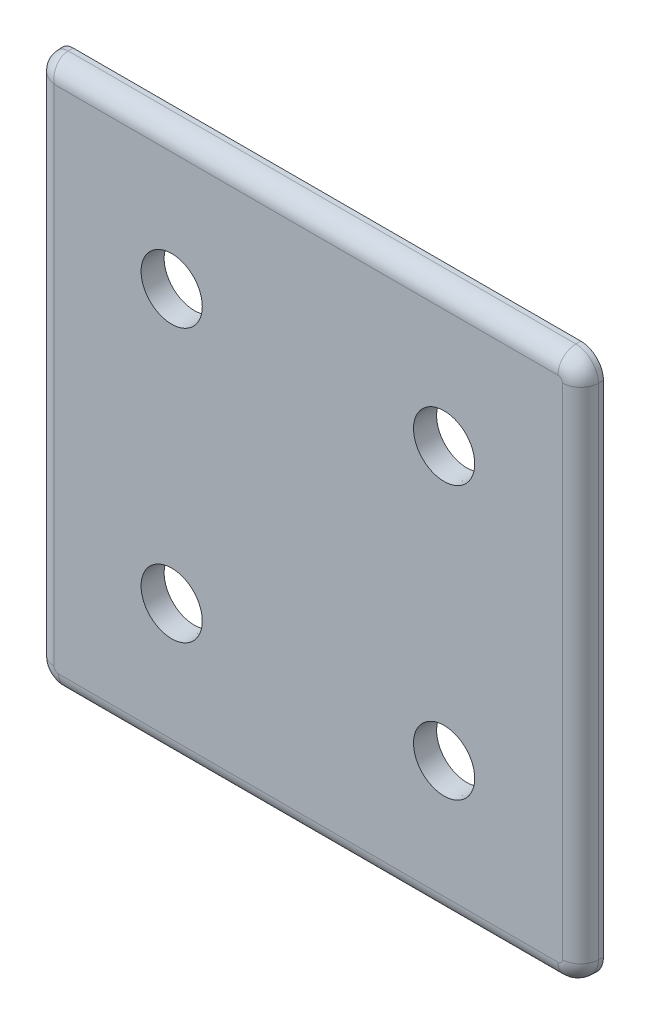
ISO-10303-21;
HEADER;
FILE_DESCRIPTION(('STEP AP214'),'2;1');
FILE_NAME('part.step','',(''),(''),'','','');
FILE_SCHEMA(('AUTOMOTIVE_DESIGN { 1 0 10303 214 1 1 1 1 }'));
ENDSEC;
DATA;
#1=APPLICATION_CONTEXT('core data for automotive mechanical design processes');
#2=APPLICATION_PROTOCOL_DEFINITION('international standard','automotive_design',2000,#1);
#3=PRODUCT_CONTEXT('',#1,'mechanical');
#4=PRODUCT('Part','Part','',(#3));
#5=PRODUCT_RELATED_PRODUCT_CATEGORY('part','',(#4));
#6=PRODUCT_DEFINITION_FORMATION('','',#4);
#7=PRODUCT_DEFINITION_CONTEXT('part definition',#1,'design');
#8=PRODUCT_DEFINITION('design','',#6,#7);
#9=PRODUCT_DEFINITION_SHAPE('','',#8);
#10=(LENGTH_UNIT() NAMED_UNIT(*) SI_UNIT(.MILLI.,.METRE.));
#11=(NAMED_UNIT(*) PLANE_ANGLE_UNIT() SI_UNIT($,.RADIAN.));
#12=(NAMED_UNIT(*) SI_UNIT($,.STERADIAN.) SOLID_ANGLE_UNIT());
#13=UNCERTAINTY_MEASURE_WITH_UNIT(LENGTH_MEASURE(1.E-05),#10,'distance_accuracy_value','');
#14=(GEOMETRIC_REPRESENTATION_CONTEXT(3) GLOBAL_UNCERTAINTY_ASSIGNED_CONTEXT((#13)) GLOBAL_UNIT_ASSIGNED_CONTEXT((#10,
#11,#12)) REPRESENTATION_CONTEXT('',''));
#15=CARTESIAN_POINT('',(0.,0.,0.));
#16=DIRECTION('',(0.,0.,1.));
#17=DIRECTION('',(1.,0.,0.));
#18=AXIS2_PLACEMENT_3D('',#15,#16,#17);
#19=CARTESIAN_POINT('',(-38.1,-38.1,0.));
#20=DIRECTION('',(-0.999847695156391,0.,0.0174524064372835));
#21=DIRECTION('',(0.0174524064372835,0.,0.999847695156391));
#22=AXIS2_PLACEMENT_3D('',#19,#20,#21);
#23=PLANE('',#22);
#24=DIRECTION('',(0.,-1.,0.));
#25=VECTOR('',#24,1.);
#26=CARTESIAN_POINT('',(-38.0881422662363,-38.1,0.6793291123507));
#27=LINE('',#26,#25);
#28=CARTESIAN_POINT('',(-38.0881422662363,-34.9136258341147,0.6793291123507));
#29=VERTEX_POINT('',#28);
#30=CARTESIAN_POINT('',(-38.0881422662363,36.0564517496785,0.6793291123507));
#31=VERTEX_POINT('',#30);
#32=EDGE_CURVE('E177',#29,#31,#27,.F.);
#33=ORIENTED_EDGE('',*,*,#32,.T.);
#34=DIRECTION('',(0.0174497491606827,-0.0174497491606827,0.999695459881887));
#35=VECTOR('',#34,1.);
#36=CARTESIAN_POINT('',(-38.0774162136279,36.0457256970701,1.29382425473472));
#37=LINE('',#36,#35);
#38=CARTESIAN_POINT('',(-38.1,36.0683094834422,0.));
#39=VERTEX_POINT('',#38);
#40=EDGE_CURVE('E52',#31,#39,#37,.F.);
#41=ORIENTED_EDGE('',*,*,#40,.T.);
#42=DIRECTION('',(0.,-1.,0.));
#43=VECTOR('',#42,1.);
#44=CARTESIAN_POINT('',(-38.1,-38.1,0.));
#45=LINE('',#44,#43);
#46=CARTESIAN_POINT('',(-38.1,-34.9254835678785,0.));
#47=VERTEX_POINT('',#46);
#48=EDGE_CURVE('E146',#39,#47,#45,.T.);
#49=ORIENTED_EDGE('',*,*,#48,.T.);
#50=DIRECTION('',(0.0174497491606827,0.0174497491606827,0.999695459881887));
#51=VECTOR('',#50,1.);
#52=CARTESIAN_POINT('',(-38.1009666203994,-34.9264501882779,-0.0553776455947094));
#53=LINE('',#52,#51);
#54=EDGE_CURVE('E156',#47,#29,#53,.T.);
#55=ORIENTED_EDGE('',*,*,#54,.T.);
#56=EDGE_LOOP('',(#33,#41,#49,#55));
#57=FACE_BOUND('',#56,.T.);
#58=ADVANCED_FACE('F30',(#57),#23,.T.);
#59=CARTESIAN_POINT('',(-38.1,-38.1,0.));
#60=DIRECTION('',(0.,-0.999847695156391,0.0174524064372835));
#61=DIRECTION('',(0.,-0.0174524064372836,-0.999847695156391));
#62=AXIS2_PLACEMENT_3D('',#59,#60,#61);
#63=PLANE('',#62);
#64=DIRECTION('',(-0.0174497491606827,0.0174497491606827,0.999695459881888));
#65=VECTOR('',#64,1.);
#66=CARTESIAN_POINT('',(34.9032477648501,-38.0777641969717,1.27388830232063));
#67=LINE('',#66,#65);
#68=CARTESIAN_POINT('',(34.9254835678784,-38.1,0.));
#69=VERTEX_POINT('',#68);
#70=CARTESIAN_POINT('',(34.9136258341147,-38.0881422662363,0.679329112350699));
#71=VERTEX_POINT('',#70);
#72=EDGE_CURVE('E134',#69,#71,#67,.T.);
#73=ORIENTED_EDGE('',*,*,#72,.T.);
#74=DIRECTION('',(1.,0.,0.));
#75=VECTOR('',#74,1.);
#76=CARTESIAN_POINT('',(-38.1,-38.0881422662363,0.6793291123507));
#77=LINE('',#76,#75);
#78=CARTESIAN_POINT('',(-34.9136258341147,-38.0881422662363,0.6793291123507));
#79=VERTEX_POINT('',#78);
#80=EDGE_CURVE('E185',#71,#79,#77,.F.);
#81=ORIENTED_EDGE('',*,*,#80,.T.);
#82=DIRECTION('',(0.0174497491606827,0.0174497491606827,0.999695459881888));
#83=VECTOR('',#82,1.);
#84=CARTESIAN_POINT('',(-34.9264501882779,-38.1009666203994,-0.0553776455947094));
#85=LINE('',#84,#83);
#86=CARTESIAN_POINT('',(-34.9254835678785,-38.1,0.));
#87=VERTEX_POINT('',#86);
#88=EDGE_CURVE('E137',#79,#87,#85,.F.);
#89=ORIENTED_EDGE('',*,*,#88,.T.);
#90=DIRECTION('',(1.,0.,0.));
#91=VECTOR('',#90,1.);
#92=CARTESIAN_POINT('',(-38.1,-38.1,0.));
#93=LINE('',#92,#91);
#94=EDGE_CURVE('E143',#87,#69,#93,.T.);
#95=ORIENTED_EDGE('',*,*,#94,.T.);
#96=EDGE_LOOP('',(#73,#81,#89,#95));
#97=FACE_BOUND('',#96,.T.);
#98=ADVANCED_FACE('F32',(#97),#63,.T.);
#99=CARTESIAN_POINT('',(38.1,-38.1,0.));
#100=DIRECTION('',(0.999847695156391,0.,0.0174524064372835));
#101=DIRECTION('',(0.0174524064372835,0.,-0.999847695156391));
#102=AXIS2_PLACEMENT_3D('',#99,#100,#101);
#103=PLANE('',#102);
#104=DIRECTION('',(-0.0174497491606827,-0.0174497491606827,0.999695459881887));
#105=VECTOR('',#104,1.);
#106=CARTESIAN_POINT('',(38.0777641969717,34.9032477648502,1.27388830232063));
#107=LINE('',#106,#105);
#108=CARTESIAN_POINT('',(38.1,34.9254835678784,0.));
#109=VERTEX_POINT('',#108);
#110=CARTESIAN_POINT('',(38.0881422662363,34.9136258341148,0.6793291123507));
#111=VERTEX_POINT('',#110);
#112=EDGE_CURVE('E128',#109,#111,#107,.T.);
#113=ORIENTED_EDGE('',*,*,#112,.T.);
#114=DIRECTION('',(0.,1.,0.));
#115=VECTOR('',#114,1.);
#116=CARTESIAN_POINT('',(38.0881422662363,-38.1,0.6793291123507));
#117=LINE('',#116,#115);
#118=CARTESIAN_POINT('',(38.0881422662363,-34.9136258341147,0.6793291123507));
#119=VERTEX_POINT('',#118);
#120=EDGE_CURVE('E124',#111,#119,#117,.F.);
#121=ORIENTED_EDGE('',*,*,#120,.T.);
#122=DIRECTION('',(-0.0174497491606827,0.0174497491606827,0.999695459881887));
#123=VECTOR('',#122,1.);
#124=CARTESIAN_POINT('',(38.1009666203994,-34.9264501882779,-0.0553776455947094));
#125=LINE('',#124,#123);
#126=CARTESIAN_POINT('',(38.1,-34.9254835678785,0.));
#127=VERTEX_POINT('',#126);
#128=EDGE_CURVE('E116',#119,#127,#125,.F.);
#129=ORIENTED_EDGE('',*,*,#128,.T.);
#130=DIRECTION('',(0.,1.,0.));
#131=VECTOR('',#130,1.);
#132=CARTESIAN_POINT('',(38.1,-38.1,0.));
#133=LINE('',#132,#131);
#134=EDGE_CURVE('E121',#127,#109,#133,.T.);
#135=ORIENTED_EDGE('',*,*,#134,.T.);
#136=EDGE_LOOP('',(#113,#121,#129,#135));
#137=FACE_BOUND('',#136,.T.);
#138=ADVANCED_FACE('F119',(#137),#103,.T.);
#139=CARTESIAN_POINT('',(-38.1,38.1,0.));
#140=DIRECTION('',(0.,0.999847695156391,0.0174524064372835));
#141=DIRECTION('',(0.,-0.0174524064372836,0.999847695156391));
#142=AXIS2_PLACEMENT_3D('',#139,#140,#141);
#143=PLANE('',#142);
#144=DIRECTION('',(-1.,0.,0.));
#145=VECTOR('',#144,1.);
#146=CARTESIAN_POINT('',(-38.1,38.1,0.));
#147=LINE('',#146,#145);
#148=CARTESIAN_POINT('',(34.9254835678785,38.1,0.));
#149=VERTEX_POINT('',#148);
#150=CARTESIAN_POINT('',(-36.0683094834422,38.1,0.));
#151=VERTEX_POINT('',#150);
#152=EDGE_CURVE('E142',#149,#151,#147,.T.);
#153=ORIENTED_EDGE('',*,*,#152,.T.);
#154=DIRECTION('',(0.0174497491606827,-0.0174497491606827,0.999695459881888));
#155=VECTOR('',#154,1.);
#156=CARTESIAN_POINT('',(-36.0689281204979,38.1006186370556,-0.035441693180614));
#157=LINE('',#156,#155);
#158=CARTESIAN_POINT('',(-36.0564517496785,38.0881422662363,0.6793291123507));
#159=VERTEX_POINT('',#158);
#160=EDGE_CURVE('E11',#151,#159,#157,.T.);
#161=ORIENTED_EDGE('',*,*,#160,.T.);
#162=DIRECTION('',(-1.,0.,0.));
#163=VECTOR('',#162,1.);
#164=CARTESIAN_POINT('',(-38.1,38.0881422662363,0.6793291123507));
#165=LINE('',#164,#163);
#166=CARTESIAN_POINT('',(34.9136258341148,38.0881422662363,0.6793291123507));
#167=VERTEX_POINT('',#166);
#168=EDGE_CURVE('E187',#159,#167,#165,.F.);
#169=ORIENTED_EDGE('',*,*,#168,.T.);
#170=DIRECTION('',(-0.0174497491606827,-0.0174497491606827,0.999695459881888));
#171=VECTOR('',#170,1.);
#172=CARTESIAN_POINT('',(34.9032477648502,38.0777641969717,1.27388830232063));
#173=LINE('',#172,#171);
#174=EDGE_CURVE('E159',#167,#149,#173,.F.);
#175=ORIENTED_EDGE('',*,*,#174,.T.);
#176=EDGE_LOOP('',(#153,#161,#169,#175));
#177=FACE_BOUND('',#176,.T.);
#178=ADVANCED_FACE('F223',(#177),#143,.T.);
#179=CARTESIAN_POINT('',(-38.1,38.1,3.175));
#180=DIRECTION('',(0.,0.,-1.));
#181=DIRECTION('',(-1.,0.,0.));
#182=AXIS2_PLACEMENT_3D('',#179,#180,#181);
#183=PLANE('',#182);
#184=DIRECTION('',(1.,0.,0.));
#185=VECTOR('',#184,1.);
#186=CARTESIAN_POINT('',(-38.1,35.548529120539,3.175));
#187=LINE('',#186,#185);
#188=CARTESIAN_POINT('',(34.9136258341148,35.548529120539,3.175));
#189=VERTEX_POINT('',#188);
#190=CARTESIAN_POINT('',(-35.5485291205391,35.548529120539,3.175));
#191=VERTEX_POINT('',#190);
#192=EDGE_CURVE('E167',#189,#191,#187,.F.);
#193=ORIENTED_EDGE('',*,*,#192,.T.);
#194=DIRECTION('',(0.,1.,0.));
#195=VECTOR('',#194,1.);
#196=CARTESIAN_POINT('',(-35.5485291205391,38.1,3.175));
#197=LINE('',#196,#195);
#198=CARTESIAN_POINT('',(-35.5485291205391,-34.9136258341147,3.175));
#199=VERTEX_POINT('',#198);
#200=EDGE_CURVE('E174',#191,#199,#197,.F.);
#201=ORIENTED_EDGE('',*,*,#200,.T.);
#202=CARTESIAN_POINT('',(-34.9134323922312,-34.9134323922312,3.175));
#203=DIRECTION('',(0.,0.,-1.));
#204=DIRECTION('',(-0.707106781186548,-0.707106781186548,0.));
#205=AXIS2_PLACEMENT_3D('',#202,#203,#204);
#206=ELLIPSE('',#205,0.635193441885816,0.635);
#207=CARTESIAN_POINT('',(-34.9136258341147,-35.5485291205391,3.175));
#208=VERTEX_POINT('',#207);
#209=EDGE_CURVE('E172',#199,#208,#206,.F.);
#210=ORIENTED_EDGE('',*,*,#209,.T.);
#211=DIRECTION('',(-1.,0.,0.));
#212=VECTOR('',#211,1.);
#213=CARTESIAN_POINT('',(-38.1,-35.5485291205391,3.175));
#214=LINE('',#213,#212);
#215=CARTESIAN_POINT('',(34.9136258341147,-35.548529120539,3.175));
#216=VERTEX_POINT('',#215);
#217=EDGE_CURVE('E170',#208,#216,#214,.F.);
#218=ORIENTED_EDGE('',*,*,#217,.T.);
#219=CARTESIAN_POINT('',(34.9134323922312,-34.9134323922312,3.175));
#220=DIRECTION('',(0.,0.,-1.));
#221=DIRECTION('',(0.707106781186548,-0.707106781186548,0.));
#222=AXIS2_PLACEMENT_3D('',#219,#220,#221);
#223=ELLIPSE('',#222,0.635193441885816,0.635);
#224=CARTESIAN_POINT('',(35.5485291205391,-34.9136258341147,3.175));
#225=VERTEX_POINT('',#224);
#226=EDGE_CURVE('E165',#216,#225,#223,.F.);
#227=ORIENTED_EDGE('',*,*,#226,.T.);
#228=DIRECTION('',(0.,-1.,0.));
#229=VECTOR('',#228,1.);
#230=CARTESIAN_POINT('',(35.5485291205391,38.1,3.175));
#231=LINE('',#230,#229);
#232=CARTESIAN_POINT('',(35.5485291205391,34.9136258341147,3.175));
#233=VERTEX_POINT('',#232);
#234=EDGE_CURVE('E161',#225,#233,#231,.F.);
#235=ORIENTED_EDGE('',*,*,#234,.T.);
#236=CARTESIAN_POINT('',(34.9134323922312,34.9134323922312,3.175));
#237=DIRECTION('',(0.,0.,-1.));
#238=DIRECTION('',(0.707106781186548,0.707106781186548,0.));
#239=AXIS2_PLACEMENT_3D('',#236,#237,#238);
#240=ELLIPSE('',#239,0.635193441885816,0.635);
#241=EDGE_CURVE('E163',#233,#189,#240,.F.);
#242=ORIENTED_EDGE('',*,*,#241,.T.);
#243=EDGE_LOOP('',(#193,#201,#210,#218,#227,#235,#242));
#244=FACE_BOUND('',#243,.T.);
#245=CARTESIAN_POINT('',(-19.1054198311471,-19.1054198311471,3.175));
#246=DIRECTION('',(0.,0.,1.));
#247=DIRECTION('',(1.,0.,0.));
#248=AXIS2_PLACEMENT_3D('',#245,#246,#247);
#249=CIRCLE('',#248,4.27990000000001);
#250=CARTESIAN_POINT('',(-14.8255198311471,-19.1054198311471,3.175));
#251=VERTEX_POINT('',#250);
#252=EDGE_CURVE('E241',#251,#251,#249,.T.);
#253=ORIENTED_EDGE('',*,*,#252,.F.);
#254=EDGE_LOOP('',(#253));
#255=FACE_BOUND('',#254,.T.);
#256=CARTESIAN_POINT('',(18.9945801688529,-19.1054198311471,3.175));
#257=DIRECTION('',(0.,0.,1.));
#258=DIRECTION('',(1.,0.,0.));
#259=AXIS2_PLACEMENT_3D('',#256,#257,#258);
#260=CIRCLE('',#259,4.27990000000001);
#261=CARTESIAN_POINT('',(23.2744801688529,-19.1054198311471,3.175));
#262=VERTEX_POINT('',#261);
#263=EDGE_CURVE('E483',#262,#262,#260,.T.);
#264=ORIENTED_EDGE('',*,*,#263,.F.);
#265=EDGE_LOOP('',(#264));
#266=FACE_BOUND('',#265,.T.);
#267=CARTESIAN_POINT('',(-19.1054198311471,18.9945801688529,3.175));
#268=DIRECTION('',(0.,0.,1.));
#269=DIRECTION('',(1.,0.,0.));
#270=AXIS2_PLACEMENT_3D('',#267,#268,#269);
#271=CIRCLE('',#270,4.2799);
#272=CARTESIAN_POINT('',(-14.8255198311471,18.9945801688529,3.175));
#273=VERTEX_POINT('',#272);
#274=EDGE_CURVE('E477',#273,#273,#271,.T.);
#275=ORIENTED_EDGE('',*,*,#274,.F.);
#276=EDGE_LOOP('',(#275));
#277=FACE_BOUND('',#276,.T.);
#278=CARTESIAN_POINT('',(18.9945801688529,18.9945801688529,3.175));
#279=DIRECTION('',(0.,0.,1.));
#280=DIRECTION('',(1.,0.,0.));
#281=AXIS2_PLACEMENT_3D('',#278,#279,#280);
#282=CIRCLE('',#281,4.27990000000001);
#283=CARTESIAN_POINT('',(23.2744801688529,18.9945801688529,3.175));
#284=VERTEX_POINT('',#283);
#285=EDGE_CURVE('E469',#284,#284,#282,.T.);
#286=ORIENTED_EDGE('',*,*,#285,.F.);
#287=EDGE_LOOP('',(#286));
#288=FACE_BOUND('',#287,.T.);
#289=ADVANCED_FACE('F206',(#244,#255,#266,#277,#288),#183,.F.);
#290=CARTESIAN_POINT('',(-38.1,38.1,0.));
#291=DIRECTION('',(0.,0.,-1.));
#292=DIRECTION('',(-1.,0.,0.));
#293=AXIS2_PLACEMENT_3D('',#290,#291,#292);
#294=PLANE('',#293);
#295=CARTESIAN_POINT('',(-19.1054198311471,-19.1054198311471,0.));
#296=DIRECTION('',(0.,0.,1.));
#297=DIRECTION('',(1.,0.,0.));
#298=AXIS2_PLACEMENT_3D('',#295,#296,#297);
#299=CIRCLE('',#298,4.22448016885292);
#300=CARTESIAN_POINT('',(-14.8809396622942,-19.1054198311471,0.));
#301=VERTEX_POINT('',#300);
#302=EDGE_CURVE('E486',#301,#301,#299,.T.);
#303=ORIENTED_EDGE('',*,*,#302,.T.);
#304=EDGE_LOOP('',(#303));
#305=FACE_BOUND('',#304,.T.);
#306=CARTESIAN_POINT('',(18.9945801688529,-19.1054198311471,0.));
#307=DIRECTION('',(0.,0.,1.));
#308=DIRECTION('',(1.,0.,0.));
#309=AXIS2_PLACEMENT_3D('',#306,#307,#308);
#310=CIRCLE('',#309,4.22448016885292);
#311=CARTESIAN_POINT('',(23.2190603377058,-19.1054198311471,0.));
#312=VERTEX_POINT('',#311);
#313=EDGE_CURVE('E480',#312,#312,#310,.T.);
#314=ORIENTED_EDGE('',*,*,#313,.T.);
#315=EDGE_LOOP('',(#314));
#316=FACE_BOUND('',#315,.T.);
#317=CARTESIAN_POINT('',(-19.1054198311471,18.9945801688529,0.));
#318=DIRECTION('',(0.,0.,1.));
#319=DIRECTION('',(1.,0.,0.));
#320=AXIS2_PLACEMENT_3D('',#317,#318,#319);
#321=CIRCLE('',#320,4.22448016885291);
#322=CARTESIAN_POINT('',(-14.8809396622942,18.9945801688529,0.));
#323=VERTEX_POINT('',#322);
#324=EDGE_CURVE('E474',#323,#323,#321,.T.);
#325=ORIENTED_EDGE('',*,*,#324,.T.);
#326=EDGE_LOOP('',(#325));
#327=FACE_BOUND('',#326,.T.);
#328=CARTESIAN_POINT('',(18.9945801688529,18.9945801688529,0.));
#329=DIRECTION('',(0.,0.,1.));
#330=DIRECTION('',(1.,0.,0.));
#331=AXIS2_PLACEMENT_3D('',#328,#329,#330);
#332=CIRCLE('',#331,4.22448016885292);
#333=CARTESIAN_POINT('',(23.2190603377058,18.9945801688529,0.));
#334=VERTEX_POINT('',#333);
#335=EDGE_CURVE('E467',#334,#334,#332,.T.);
#336=ORIENTED_EDGE('',*,*,#335,.T.);
#337=EDGE_LOOP('',(#336));
#338=FACE_BOUND('',#337,.T.);
#339=ORIENTED_EDGE('',*,*,#48,.F.);
#340=CARTESIAN_POINT('',(-36.0676904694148,36.0676904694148,0.));
#341=DIRECTION('',(0.,0.,-1.));
#342=DIRECTION('',(-0.707106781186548,0.707106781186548,0.));
#343=AXIS2_PLACEMENT_3D('',#340,#341,#342);
#344=ELLIPSE('',#343,2.03261901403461,2.032);
#345=EDGE_CURVE('E38',#39,#151,#344,.T.);
#346=ORIENTED_EDGE('',*,*,#345,.T.);
#347=ORIENTED_EDGE('',*,*,#152,.F.);
#348=CARTESIAN_POINT('',(34.9245163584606,34.9245163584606,0.));
#349=DIRECTION('',(0.,0.,-1.));
#350=DIRECTION('',(0.707106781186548,0.707106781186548,0.));
#351=AXIS2_PLACEMENT_3D('',#348,#349,#350);
#352=ELLIPSE('',#351,3.17596720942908,3.175);
#353=EDGE_CURVE('E127',#149,#109,#352,.T.);
#354=ORIENTED_EDGE('',*,*,#353,.T.);
#355=ORIENTED_EDGE('',*,*,#134,.F.);
#356=CARTESIAN_POINT('',(34.9245163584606,-34.9245163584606,0.));
#357=DIRECTION('',(0.,0.,-1.));
#358=DIRECTION('',(0.707106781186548,-0.707106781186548,0.));
#359=AXIS2_PLACEMENT_3D('',#356,#357,#358);
#360=ELLIPSE('',#359,3.17596720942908,3.175);
#361=EDGE_CURVE('E131',#127,#69,#360,.T.);
#362=ORIENTED_EDGE('',*,*,#361,.T.);
#363=ORIENTED_EDGE('',*,*,#94,.F.);
#364=CARTESIAN_POINT('',(-34.9245163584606,-34.9245163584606,0.));
#365=DIRECTION('',(0.,0.,-1.));
#366=DIRECTION('',(-0.707106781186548,-0.707106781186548,0.));
#367=AXIS2_PLACEMENT_3D('',#364,#365,#366);
#368=ELLIPSE('',#367,3.17596720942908,3.175);
#369=EDGE_CURVE('E138',#87,#47,#368,.T.);
#370=ORIENTED_EDGE('',*,*,#369,.T.);
#371=EDGE_LOOP('',(#339,#346,#347,#354,#355,#362,#363,#370));
#372=FACE_BOUND('',#371,.T.);
#373=ADVANCED_FACE('F140',(#305,#316,#327,#338,#372),#294,.T.);
#374=CARTESIAN_POINT('',(18.9945801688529,18.9945801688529,3.175));
#375=DIRECTION('',(0.,0.,1.));
#376=DIRECTION('',(1.,0.,0.));
#377=AXIS2_PLACEMENT_3D('',#374,#375,#376);
#378=CONICAL_SURFACE('',#377,4.27990000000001,0.0174532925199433);
#379=ORIENTED_EDGE('',*,*,#335,.F.);
#380=EDGE_LOOP('',(#379));
#381=FACE_BOUND('',#380,.T.);
#382=ORIENTED_EDGE('',*,*,#285,.T.);
#383=EDGE_LOOP('',(#382));
#384=FACE_BOUND('',#383,.T.);
#385=ADVANCED_FACE('F327',(#381,#384),#378,.F.);
#386=CARTESIAN_POINT('',(-19.1054198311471,18.9945801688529,3.175));
#387=DIRECTION('',(0.,0.,1.));
#388=DIRECTION('',(1.,0.,0.));
#389=AXIS2_PLACEMENT_3D('',#386,#387,#388);
#390=CONICAL_SURFACE('',#389,4.2799,0.0174532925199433);
#391=ORIENTED_EDGE('',*,*,#324,.F.);
#392=EDGE_LOOP('',(#391));
#393=FACE_BOUND('',#392,.T.);
#394=ORIENTED_EDGE('',*,*,#274,.T.);
#395=EDGE_LOOP('',(#394));
#396=FACE_BOUND('',#395,.T.);
#397=ADVANCED_FACE('F335',(#393,#396),#390,.F.);
#398=CARTESIAN_POINT('',(18.9945801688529,-19.1054198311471,3.175));
#399=DIRECTION('',(0.,0.,1.));
#400=DIRECTION('',(1.,0.,0.));
#401=AXIS2_PLACEMENT_3D('',#398,#399,#400);
#402=CONICAL_SURFACE('',#401,4.27990000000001,0.0174532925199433);
#403=ORIENTED_EDGE('',*,*,#313,.F.);
#404=EDGE_LOOP('',(#403));
#405=FACE_BOUND('',#404,.T.);
#406=ORIENTED_EDGE('',*,*,#263,.T.);
#407=EDGE_LOOP('',(#406));
#408=FACE_BOUND('',#407,.T.);
#409=ADVANCED_FACE('F343',(#405,#408),#402,.F.);
#410=CARTESIAN_POINT('',(-19.1054198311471,-19.1054198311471,3.175));
#411=DIRECTION('',(0.,0.,1.));
#412=DIRECTION('',(1.,0.,0.));
#413=AXIS2_PLACEMENT_3D('',#410,#411,#412);
#414=CONICAL_SURFACE('',#413,4.27990000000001,0.0174532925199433);
#415=ORIENTED_EDGE('',*,*,#302,.F.);
#416=EDGE_LOOP('',(#415));
#417=FACE_BOUND('',#416,.T.);
#418=ORIENTED_EDGE('',*,*,#252,.T.);
#419=EDGE_LOOP('',(#418));
#420=FACE_BOUND('',#419,.T.);
#421=ADVANCED_FACE('F351',(#417,#420),#414,.F.);
#422=CARTESIAN_POINT('',(34.9264501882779,-34.9264501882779,-0.110789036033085));
#423=DIRECTION('',(0.0174497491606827,-0.0174497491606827,-0.999695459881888));
#424=DIRECTION('',(-0.999847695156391,0.,-0.0174524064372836));
#425=AXIS2_PLACEMENT_3D('',#422,#423,#424);
#426=CYLINDRICAL_SURFACE('',#425,3.175);
#427=ORIENTED_EDGE('',*,*,#128,.F.);
#428=CARTESIAN_POINT('',(34.9134323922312,-34.9134323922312,0.635));
#429=DIRECTION('',(-0.0139596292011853,0.0139596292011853,0.999805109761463));
#430=DIRECTION('',(0.706968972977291,-0.706968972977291,0.0197418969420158));
#431=AXIS2_PLACEMENT_3D('',#428,#429,#430);
#432=ELLIPSE('',#431,3.17503869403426,3.175);
#433=EDGE_CURVE('E181',#119,#71,#432,.F.);
#434=ORIENTED_EDGE('',*,*,#433,.T.);
#435=ORIENTED_EDGE('',*,*,#72,.F.);
#436=ORIENTED_EDGE('',*,*,#361,.F.);
#437=EDGE_LOOP('',(#427,#434,#435,#436));
#438=FACE_BOUND('',#437,.T.);
#439=ADVANCED_FACE('F132',(#438),#426,.T.);
#440=CARTESIAN_POINT('',(-34.9264501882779,-34.9264501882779,-0.110789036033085));
#441=DIRECTION('',(-0.0174497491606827,-0.0174497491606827,-0.999695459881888));
#442=DIRECTION('',(-0.999847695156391,0.,0.0174524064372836));
#443=AXIS2_PLACEMENT_3D('',#440,#441,#442);
#444=CYLINDRICAL_SURFACE('',#443,3.175);
#445=ORIENTED_EDGE('',*,*,#88,.F.);
#446=CARTESIAN_POINT('',(-34.9134323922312,-34.9134323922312,0.635));
#447=DIRECTION('',(0.0139596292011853,0.0139596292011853,0.999805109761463));
#448=DIRECTION('',(-0.706968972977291,-0.706968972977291,0.0197418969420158));
#449=AXIS2_PLACEMENT_3D('',#446,#447,#448);
#450=ELLIPSE('',#449,3.17503869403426,3.175);
#451=EDGE_CURVE('E179',#79,#29,#450,.F.);
#452=ORIENTED_EDGE('',*,*,#451,.T.);
#453=ORIENTED_EDGE('',*,*,#54,.F.);
#454=ORIENTED_EDGE('',*,*,#369,.F.);
#455=EDGE_LOOP('',(#445,#452,#453,#454));
#456=FACE_BOUND('',#455,.T.);
#457=ADVANCED_FACE('F267',(#456),#444,.T.);
#458=CARTESIAN_POINT('',(34.9032477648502,34.9032477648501,1.21847691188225));
#459=DIRECTION('',(0.0174497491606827,0.0174497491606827,-0.999695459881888));
#460=DIRECTION('',(-0.999847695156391,0.,-0.0174524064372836));
#461=AXIS2_PLACEMENT_3D('',#458,#459,#460);
#462=CYLINDRICAL_SURFACE('',#461,3.175);
#463=ORIENTED_EDGE('',*,*,#174,.F.);
#464=CARTESIAN_POINT('',(34.9134323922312,34.9134323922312,0.635));
#465=DIRECTION('',(-0.0139596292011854,-0.0139596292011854,0.999805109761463));
#466=DIRECTION('',(0.706968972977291,0.706968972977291,0.0197418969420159));
#467=AXIS2_PLACEMENT_3D('',#464,#465,#466);
#468=ELLIPSE('',#467,3.17503869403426,3.175);
#469=EDGE_CURVE('E183',#167,#111,#468,.F.);
#470=ORIENTED_EDGE('',*,*,#469,.T.);
#471=ORIENTED_EDGE('',*,*,#112,.F.);
#472=ORIENTED_EDGE('',*,*,#353,.F.);
#473=EDGE_LOOP('',(#463,#470,#471,#472));
#474=FACE_BOUND('',#473,.T.);
#475=ADVANCED_FACE('F227',(#474),#462,.T.);
#476=CARTESIAN_POINT('',(35.5485291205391,38.1,0.635));
#477=DIRECTION('',(0.,-1.,0.));
#478=DIRECTION('',(0.,0.,-1.));
#479=AXIS2_PLACEMENT_3D('',#476,#477,#478);
#480=CYLINDRICAL_SURFACE('',#479,2.54);
#481=CARTESIAN_POINT('',(35.5485291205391,34.9136258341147,0.635));
#482=DIRECTION('',(0.,1.,0.));
#483=DIRECTION('',(-1.,0.,0.));
#484=AXIS2_PLACEMENT_3D('',#481,#482,#483);
#485=CIRCLE('',#484,2.54);
#486=EDGE_CURVE('E233',#233,#111,#485,.T.);
#487=ORIENTED_EDGE('',*,*,#486,.F.);
#488=ORIENTED_EDGE('',*,*,#234,.F.);
#489=CARTESIAN_POINT('',(35.5485291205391,-34.9136258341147,0.635));
#490=DIRECTION('',(0.,-1.,0.));
#491=DIRECTION('',(0.,0.,-1.));
#492=AXIS2_PLACEMENT_3D('',#489,#490,#491);
#493=CIRCLE('',#492,2.54);
#494=EDGE_CURVE('E235',#119,#225,#493,.T.);
#495=ORIENTED_EDGE('',*,*,#494,.F.);
#496=ORIENTED_EDGE('',*,*,#120,.F.);
#497=EDGE_LOOP('',(#487,#488,#495,#496));
#498=FACE_BOUND('',#497,.T.);
#499=ADVANCED_FACE('F231',(#498),#480,.T.);
#500=CARTESIAN_POINT('',(35.3625819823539,-35.3625819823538,3.175));
#501=CARTESIAN_POINT('',(37.1148444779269,-37.1148444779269,3.175));
#502=CARTESIAN_POINT('',(37.1580862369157,-37.1580862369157,0.697681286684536));
#503=CARTESIAN_POINT('',(35.3429901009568,-35.3821738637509,3.175));
#504=CARTESIAN_POINT('',(37.0187724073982,-37.2109165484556,3.175));
#505=CARTESIAN_POINT('',(37.0601268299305,-37.2560456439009,0.697681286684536));
#506=CARTESIAN_POINT('',(35.3221137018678,-35.4004812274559,3.175));
#507=CARTESIAN_POINT('',(36.9165187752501,-37.3008202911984,3.175));
#508=CARTESIAN_POINT('',(36.9557479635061,-37.3475855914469,0.697502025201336));
#509=CARTESIAN_POINT('',(35.2781490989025,-35.4342137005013,3.175));
#510=CARTESIAN_POINT('',(36.7013217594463,-37.4668119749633,3.175));
#511=CARTESIAN_POINT('',(36.7359374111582,-37.5162604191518,0.696788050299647));
#512=CARTESIAN_POINT('',(35.2550608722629,-35.4496387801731,3.175));
#513=CARTESIAN_POINT('',(36.5883620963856,-37.5429092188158,3.175));
#514=CARTESIAN_POINT('',(36.6205056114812,-37.5933951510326,0.696253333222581));
#515=CARTESIAN_POINT('',(35.2070676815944,-35.4773427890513,3.175));
#516=CARTESIAN_POINT('',(36.3535647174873,-37.6800427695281,3.175));
#517=CARTESIAN_POINT('',(36.3805643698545,-37.7319399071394,0.694837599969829));
#518=CARTESIAN_POINT('',(35.1821626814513,-35.4896216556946,3.175));
#519=CARTESIAN_POINT('',(36.2317087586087,-37.7410838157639,3.175));
#520=CARTESIAN_POINT('',(36.2560547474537,-37.7933496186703,0.693956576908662));
#521=CARTESIAN_POINT('',(35.1309620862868,-35.5108231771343,3.175));
#522=CARTESIAN_POINT('',(35.9810720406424,-37.8470850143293,3.175));
#523=CARTESIAN_POINT('',(36.0000883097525,-37.89939376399,0.69186330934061));
#524=CARTESIAN_POINT('',(35.1046664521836,-35.5197457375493,3.175));
#525=CARTESIAN_POINT('',(35.8522722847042,-37.8920450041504,3.175));
#526=CARTESIAN_POINT('',(35.8686312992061,-37.9440277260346,0.690651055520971));
#527=CARTESIAN_POINT('',(35.0511345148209,-35.5340820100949,3.175));
#528=CARTESIAN_POINT('',(35.5898178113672,-37.9651051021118,3.175));
#529=CARTESIAN_POINT('',(35.6010193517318,-38.0157568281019,0.687916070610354));
#530=CARTESIAN_POINT('',(35.0238981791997,-35.5394956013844,3.175));
#531=CARTESIAN_POINT('',(35.4561446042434,-37.9932001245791,3.175));
#532=CARTESIAN_POINT('',(35.4648642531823,-38.0428513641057,0.686393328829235));
#533=CARTESIAN_POINT('',(34.9689508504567,-35.5467213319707,3.175));
#534=CARTESIAN_POINT('',(35.1861028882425,-38.032006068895,3.175));
#535=CARTESIAN_POINT('',(35.1901857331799,-38.0790381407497,0.683063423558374));
#536=CARTESIAN_POINT('',(34.9412398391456,-35.5485333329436,3.175));
#537=CARTESIAN_POINT('',(35.049717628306,-38.0427072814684,3.175));
#538=CARTESIAN_POINT('',(35.051662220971,-38.0881296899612,0.681256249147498));
#539=CARTESIAN_POINT('',(34.8858172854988,-35.5485248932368,3.175));
#540=CARTESIAN_POINT('',(34.7764726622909,-38.0464677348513,3.175));
#541=CARTESIAN_POINT('',(34.7746169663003,-38.0881550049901,0.677388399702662));
#542=CARTESIAN_POINT('',(34.8581057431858,-35.546704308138,3.175));
#543=CARTESIAN_POINT('',(34.6395990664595,-38.0395132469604,3.175));
#544=CARTESIAN_POINT('',(34.6360952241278,-38.0790880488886,0.675327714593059));
#545=CARTESIAN_POINT('',(34.8031562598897,-35.539461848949,3.175));
#546=CARTESIAN_POINT('',(34.3676289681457,-38.0079798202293,3.175));
#547=CARTESIAN_POINT('',(34.361423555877,-38.0429515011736,0.670988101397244));
#548=CARTESIAN_POINT('',(34.7759183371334,-35.5340398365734,3.175));
#549=CARTESIAN_POINT('',(34.2325223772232,-37.9833840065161,3.175));
#550=CARTESIAN_POINT('',(34.2252737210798,-38.0158812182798,0.668709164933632));
#551=CARTESIAN_POINT('',(34.7223821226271,-35.5196872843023,3.175));
#552=CARTESIAN_POINT('',(33.9663361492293,-37.9168669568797,3.175));
#553=CARTESIAN_POINT('',(33.9576753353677,-37.9442011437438,0.663972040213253));
#554=CARTESIAN_POINT('',(34.6960838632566,-35.5107566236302,3.175));
#555=CARTESIAN_POINT('',(33.8352509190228,-37.8749267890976,3.175));
#556=CARTESIAN_POINT('',(33.8262269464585,-37.8995907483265,0.661513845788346));
#557=CARTESIAN_POINT('',(34.6448769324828,-35.4895395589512,3.175));
#558=CARTESIAN_POINT('',(33.5793215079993,-37.7743042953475,3.175));
#559=CARTESIAN_POINT('',(33.570280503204,-37.7935936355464,0.656460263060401));
#560=CARTESIAN_POINT('',(34.6199683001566,-35.4772530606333,3.175));
#561=CARTESIAN_POINT('',(33.4544766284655,-37.715602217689,3.175));
#562=CARTESIAN_POINT('',(33.4457826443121,-37.7322064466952,0.653864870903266));
#563=CARTESIAN_POINT('',(34.5719668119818,-35.4495345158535,3.175));
#564=CARTESIAN_POINT('',(33.2131706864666,-37.5823222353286,3.175));
#565=CARTESIAN_POINT('',(33.2058674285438,-37.5937059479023,0.648581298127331));
#566=CARTESIAN_POINT('',(34.5488739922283,-35.4341024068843,3.175));
#567=CARTESIAN_POINT('',(33.0967138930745,-37.5077250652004,3.175));
#568=CARTESIAN_POINT('',(33.0904502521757,-37.5165923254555,0.645893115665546));
#569=CARTESIAN_POINT('',(34.504899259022,-35.4003566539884,3.175));
#570=CARTESIAN_POINT('',(32.8742189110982,-37.3437987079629,3.175));
#571=CARTESIAN_POINT('',(32.8706712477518,-37.3479582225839,0.640469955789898));
#572=CARTESIAN_POINT('',(34.4840173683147,-35.3820429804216,3.175));
#573=CARTESIAN_POINT('',(32.7681896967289,-37.2544520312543,3.175));
#574=CARTESIAN_POINT('',(32.7663095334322,-37.2564375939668,0.637734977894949));
#575=CARTESIAN_POINT('',(34.4448218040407,-35.3428474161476,3.175));
#576=CARTESIAN_POINT('',(32.5684394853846,-37.062437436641,3.175));
#577=CARTESIAN_POINT('',(32.5704271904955,-37.0605552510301,0.632265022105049));
#578=CARTESIAN_POINT('',(34.4265081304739,-35.3219655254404,3.175));
#579=CARTESIAN_POINT('',(32.4747315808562,-36.9597549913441,3.175));
#580=CARTESIAN_POINT('',(32.4789065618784,-36.9561935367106,0.629530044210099));
#581=CARTESIAN_POINT('',(34.3927623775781,-35.277990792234,3.175));
#582=CARTESIAN_POINT('',(32.3013314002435,-36.7427307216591,3.175));
#583=CARTESIAN_POINT('',(32.3102724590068,-36.7364145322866,0.624106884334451));
#584=CARTESIAN_POINT('',(34.3773302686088,-35.2548979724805,3.175));
#585=CARTESIAN_POINT('',(32.2216554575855,-36.6283783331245,3.175));
#586=CARTESIAN_POINT('',(32.2331588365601,-36.6209973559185,0.621418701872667));
#587=CARTESIAN_POINT('',(34.3496117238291,-35.2068964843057,3.175));
#588=CARTESIAN_POINT('',(32.077808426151,-36.3899055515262,3.175));
#589=CARTESIAN_POINT('',(32.0946583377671,-36.3810821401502,0.616135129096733));
#590=CARTESIAN_POINT('',(34.3373252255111,-35.1819878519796,3.175));
#591=CARTESIAN_POINT('',(32.0136557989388,-36.2657793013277,3.175));
#592=CARTESIAN_POINT('',(32.033271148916,-36.2565842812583,0.613539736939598));
#593=CARTESIAN_POINT('',(34.3161081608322,-35.1307809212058,3.175));
#594=CARTESIAN_POINT('',(31.9020925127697,-36.0098522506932,3.175));
#595=CARTESIAN_POINT('',(31.9272740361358,-36.0006378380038,0.608486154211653));
#596=CARTESIAN_POINT('',(34.30717750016,-35.1044826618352,3.175));
#597=CARTESIAN_POINT('',(31.854701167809,-35.8780507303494,3.175));
#598=CARTESIAN_POINT('',(31.8826636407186,-35.8691894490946,0.606027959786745));
#599=CARTESIAN_POINT('',(34.2928249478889,-35.0509464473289,3.175));
#600=CARTESIAN_POINT('',(31.7776147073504,-35.60903542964,3.175));
#601=CARTESIAN_POINT('',(31.8109835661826,-35.6015910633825,0.601290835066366));
#602=CARTESIAN_POINT('',(34.2874029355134,-35.0237085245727,3.175));
#603=CARTESIAN_POINT('',(31.7479384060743,-35.471826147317,3.175));
#604=CARTESIAN_POINT('',(31.7839132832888,-35.4654412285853,0.599011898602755));
#605=CARTESIAN_POINT('',(34.2801604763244,-34.9687590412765,3.175));
#606=CARTESIAN_POINT('',(31.7069270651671,-35.1943876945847,3.175));
#607=CARTESIAN_POINT('',(31.7477767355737,-35.1907695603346,0.59467228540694));
#608=CARTESIAN_POINT('',(34.2783398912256,-34.9410474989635,3.175));
#609=CARTESIAN_POINT('',(31.6956090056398,-35.054167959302,3.175));
#610=CARTESIAN_POINT('',(31.7387097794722,-35.0522478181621,0.592611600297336));
#611=CARTESIAN_POINT('',(34.2783314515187,-34.8856249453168,3.175));
#612=CARTESIAN_POINT('',(31.6916291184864,-34.7731873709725,3.175));
#613=CARTESIAN_POINT('',(31.7387350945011,-34.7752025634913,0.588743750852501));
#614=CARTESIAN_POINT('',(34.2801434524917,-34.8579139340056,3.175));
#615=CARTESIAN_POINT('',(31.698981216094,-34.632440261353,3.175));
#616=CARTESIAN_POINT('',(31.7478266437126,-34.6366790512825,0.586936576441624));
#617=CARTESIAN_POINT('',(34.2873691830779,-34.8029666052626,3.175));
#618=CARTESIAN_POINT('',(31.7323123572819,-34.352922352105,3.175));
#619=CARTESIAN_POINT('',(31.7840134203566,-34.3620005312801,0.583606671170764));
#620=CARTESIAN_POINT('',(34.2927827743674,-34.7757302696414,3.175));
#621=CARTESIAN_POINT('',(31.7583012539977,-34.2141686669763,3.175));
#622=CARTESIAN_POINT('',(31.8111079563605,-34.2258454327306,0.582083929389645));
#623=CARTESIAN_POINT('',(34.307119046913,-34.7221983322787,3.175));
#624=CARTESIAN_POINT('',(31.8285258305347,-33.9411430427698,3.175));
#625=CARTESIAN_POINT('',(31.8828370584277,-33.9582334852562,0.579348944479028));
#626=CARTESIAN_POINT('',(34.3160416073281,-34.6959026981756,3.175));
#627=CARTESIAN_POINT('',(31.8727665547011,-33.806890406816,3.175));
#628=CARTESIAN_POINT('',(31.9274710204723,-33.8267764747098,0.578136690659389));
#629=CARTESIAN_POINT('',(34.3372431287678,-34.6447021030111,3.175));
#630=CARTESIAN_POINT('',(31.9787653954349,-33.5453081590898,3.175));
#631=CARTESIAN_POINT('',(32.033515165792,-33.5708100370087,0.576043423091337));
#632=CARTESIAN_POINT('',(34.349521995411,-34.619797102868,3.175));
#633=CARTESIAN_POINT('',(32.0405233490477,-33.4179986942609,3.175));
#634=CARTESIAN_POINT('',(32.0949248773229,-33.4463004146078,0.57516240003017));
#635=CARTESIAN_POINT('',(34.3772260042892,-34.5718039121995,3.175));
#636=CARTESIAN_POINT('',(32.1804883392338,-33.1726277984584,3.175));
#637=CARTESIAN_POINT('',(32.2334696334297,-33.2063591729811,0.573746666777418));
#638=CARTESIAN_POINT('',(34.3926510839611,-34.5487156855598,3.175));
#639=CARTESIAN_POINT('',(32.2586899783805,-33.0545859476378,3.175));
#640=CARTESIAN_POINT('',(32.3106043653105,-33.0909273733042,0.573211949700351));
#641=CARTESIAN_POINT('',(34.4263835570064,-34.5047510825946,3.175));
#642=CARTESIAN_POINT('',(32.4301541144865,-32.8299086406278,3.175));
#643=CARTESIAN_POINT('',(32.4792791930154,-32.8711168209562,0.572497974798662));
#644=CARTESIAN_POINT('',(34.4446909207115,-34.4838746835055,3.175));
#645=CARTESIAN_POINT('',(32.5234063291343,-32.7232908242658,3.175));
#646=CARTESIAN_POINT('',(32.5708191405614,-32.7667379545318,0.572318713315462));
#647=CARTESIAN_POINT('',(34.4838746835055,-34.4446909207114,3.175));
#648=CARTESIAN_POINT('',(32.7232908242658,-32.5234063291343,3.175));
#649=CARTESIAN_POINT('',(32.7667379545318,-32.5708191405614,0.572318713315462));
#650=CARTESIAN_POINT('',(34.5047510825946,-34.4263835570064,3.175));
#651=CARTESIAN_POINT('',(32.8299086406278,-32.4301541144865,3.175));
#652=CARTESIAN_POINT('',(32.8711168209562,-32.4792791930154,0.572497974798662));
#653=CARTESIAN_POINT('',(34.5487156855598,-34.3926510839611,3.175));
#654=CARTESIAN_POINT('',(33.0545859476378,-32.2586899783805,3.175));
#655=CARTESIAN_POINT('',(33.0909273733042,-32.3106043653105,0.573211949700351));
#656=CARTESIAN_POINT('',(34.5718039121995,-34.3772260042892,3.175));
#657=CARTESIAN_POINT('',(33.1726277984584,-32.1804883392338,3.175));
#658=CARTESIAN_POINT('',(33.2063591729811,-32.2334696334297,0.573746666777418));
#659=CARTESIAN_POINT('',(34.619797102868,-34.349521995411,3.175));
#660=CARTESIAN_POINT('',(33.4179986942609,-32.0405233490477,3.175));
#661=CARTESIAN_POINT('',(33.4463004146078,-32.0949248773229,0.57516240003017));
#662=CARTESIAN_POINT('',(34.6447021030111,-34.3372431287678,3.175));
#663=CARTESIAN_POINT('',(33.5453081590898,-31.9787653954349,3.175));
#664=CARTESIAN_POINT('',(33.5708100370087,-32.033515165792,0.576043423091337));
#665=CARTESIAN_POINT('',(34.6959026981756,-34.3160416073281,3.175));
#666=CARTESIAN_POINT('',(33.806890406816,-31.8727665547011,3.175));
#667=CARTESIAN_POINT('',(33.8267764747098,-31.9274710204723,0.578136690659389));
#668=CARTESIAN_POINT('',(34.7221983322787,-34.307119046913,3.175));
#669=CARTESIAN_POINT('',(33.9411430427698,-31.8285258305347,3.175));
#670=CARTESIAN_POINT('',(33.9582334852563,-31.8828370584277,0.579348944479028));
#671=CARTESIAN_POINT('',(34.7757302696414,-34.2927827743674,3.175));
#672=CARTESIAN_POINT('',(34.2141686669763,-31.7583012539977,3.175));
#673=CARTESIAN_POINT('',(34.2258454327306,-31.8111079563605,0.582083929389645));
#674=CARTESIAN_POINT('',(34.8029666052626,-34.2873691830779,3.175));
#675=CARTESIAN_POINT('',(34.352922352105,-31.7323123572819,3.175));
#676=CARTESIAN_POINT('',(34.3620005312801,-31.7840134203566,0.583606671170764));
#677=CARTESIAN_POINT('',(34.8579139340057,-34.2801434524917,3.175));
#678=CARTESIAN_POINT('',(34.632440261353,-31.6989812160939,3.175));
#679=CARTESIAN_POINT('',(34.6366790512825,-31.7478266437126,0.586936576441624));
#680=CARTESIAN_POINT('',(34.8856249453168,-34.2783314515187,3.175));
#681=CARTESIAN_POINT('',(34.7731873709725,-31.6916291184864,3.175));
#682=CARTESIAN_POINT('',(34.7752025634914,-31.7387350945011,0.588743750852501));
#683=CARTESIAN_POINT('',(34.9410474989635,-34.2783398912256,3.175));
#684=CARTESIAN_POINT('',(35.054167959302,-31.6956090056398,3.175));
#685=CARTESIAN_POINT('',(35.0522478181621,-31.7387097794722,0.592611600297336));
#686=CARTESIAN_POINT('',(34.9687590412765,-34.2801604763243,3.175));
#687=CARTESIAN_POINT('',(35.1943876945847,-31.706927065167,3.175));
#688=CARTESIAN_POINT('',(35.1907695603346,-31.7477767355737,0.59467228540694));
#689=CARTESIAN_POINT('',(35.0237085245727,-34.2874029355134,3.175));
#690=CARTESIAN_POINT('',(35.471826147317,-31.7479384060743,3.175));
#691=CARTESIAN_POINT('',(35.4654412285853,-31.7839132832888,0.599011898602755));
#692=CARTESIAN_POINT('',(35.0509464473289,-34.2928249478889,3.175));
#693=CARTESIAN_POINT('',(35.60903542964,-31.7776147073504,3.175));
#694=CARTESIAN_POINT('',(35.6015910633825,-31.8109835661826,0.601290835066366));
#695=CARTESIAN_POINT('',(35.1044826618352,-34.30717750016,3.175));
#696=CARTESIAN_POINT('',(35.8780507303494,-31.854701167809,3.175));
#697=CARTESIAN_POINT('',(35.8691894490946,-31.8826636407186,0.606027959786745));
#698=CARTESIAN_POINT('',(35.1307809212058,-34.3161081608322,3.175));
#699=CARTESIAN_POINT('',(36.0098522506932,-31.9020925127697,3.175));
#700=CARTESIAN_POINT('',(36.0006378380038,-31.9272740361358,0.608486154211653));
#701=CARTESIAN_POINT('',(35.1819878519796,-34.3373252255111,3.175));
#702=CARTESIAN_POINT('',(36.2657793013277,-32.0136557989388,3.175));
#703=CARTESIAN_POINT('',(36.2565842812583,-32.0332711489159,0.613539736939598));
#704=CARTESIAN_POINT('',(35.2068964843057,-34.3496117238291,3.175));
#705=CARTESIAN_POINT('',(36.3899055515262,-32.077808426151,3.175));
#706=CARTESIAN_POINT('',(36.3810821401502,-32.0946583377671,0.616135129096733));
#707=CARTESIAN_POINT('',(35.2548979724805,-34.3773302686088,3.175));
#708=CARTESIAN_POINT('',(36.6283783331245,-32.2216554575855,3.175));
#709=CARTESIAN_POINT('',(36.6209973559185,-32.2331588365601,0.621418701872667));
#710=CARTESIAN_POINT('',(35.277990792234,-34.3927623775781,3.175));
#711=CARTESIAN_POINT('',(36.7427307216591,-32.3013314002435,3.175));
#712=CARTESIAN_POINT('',(36.7364145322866,-32.3102724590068,0.624106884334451));
#713=CARTESIAN_POINT('',(35.3219655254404,-34.4265081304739,3.175));
#714=CARTESIAN_POINT('',(36.9597549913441,-32.4747315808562,3.175));
#715=CARTESIAN_POINT('',(36.9561935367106,-32.4789065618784,0.629530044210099));
#716=CARTESIAN_POINT('',(35.3428474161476,-34.4448218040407,3.175));
#717=CARTESIAN_POINT('',(37.062437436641,-32.5684394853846,3.175));
#718=CARTESIAN_POINT('',(37.0605552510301,-32.5704271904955,0.632265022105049));
#719=CARTESIAN_POINT('',(35.3820429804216,-34.4840173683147,3.175));
#720=CARTESIAN_POINT('',(37.2544520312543,-32.7681896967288,3.175));
#721=CARTESIAN_POINT('',(37.2564375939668,-32.7663095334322,0.637734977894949));
#722=CARTESIAN_POINT('',(35.4003566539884,-34.504899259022,3.175));
#723=CARTESIAN_POINT('',(37.3437987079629,-32.8742189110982,3.175));
#724=CARTESIAN_POINT('',(37.3479582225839,-32.8706712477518,0.640469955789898));
#725=CARTESIAN_POINT('',(35.4341024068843,-34.5488739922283,3.175));
#726=CARTESIAN_POINT('',(37.5077250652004,-33.0967138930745,3.175));
#727=CARTESIAN_POINT('',(37.5165923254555,-33.0904502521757,0.645893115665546));
#728=CARTESIAN_POINT('',(35.4495345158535,-34.5719668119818,3.175));
#729=CARTESIAN_POINT('',(37.5823222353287,-33.2131706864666,3.175));
#730=CARTESIAN_POINT('',(37.5937059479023,-33.2058674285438,0.648581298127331));
#731=CARTESIAN_POINT('',(35.4772530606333,-34.6199683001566,3.175));
#732=CARTESIAN_POINT('',(37.7156022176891,-33.4544766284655,3.175));
#733=CARTESIAN_POINT('',(37.7322064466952,-33.4457826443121,0.653864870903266));
#734=CARTESIAN_POINT('',(35.4895395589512,-34.6448769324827,3.175));
#735=CARTESIAN_POINT('',(37.7743042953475,-33.5793215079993,3.175));
#736=CARTESIAN_POINT('',(37.7935936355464,-33.570280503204,0.656460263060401));
#737=CARTESIAN_POINT('',(35.5107566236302,-34.6960838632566,3.175));
#738=CARTESIAN_POINT('',(37.8749267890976,-33.8352509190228,3.175));
#739=CARTESIAN_POINT('',(37.8995907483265,-33.8262269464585,0.661513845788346));
#740=CARTESIAN_POINT('',(35.5196872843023,-34.7223821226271,3.175));
#741=CARTESIAN_POINT('',(37.9168669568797,-33.9663361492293,3.175));
#742=CARTESIAN_POINT('',(37.9442011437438,-33.9576753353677,0.663972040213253));
#743=CARTESIAN_POINT('',(35.5340398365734,-34.7759183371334,3.175));
#744=CARTESIAN_POINT('',(37.9833840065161,-34.2325223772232,3.175));
#745=CARTESIAN_POINT('',(38.0158812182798,-34.2252737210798,0.668709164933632));
#746=CARTESIAN_POINT('',(35.539461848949,-34.8031562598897,3.175));
#747=CARTESIAN_POINT('',(38.0079798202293,-34.3676289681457,3.175));
#748=CARTESIAN_POINT('',(38.0429515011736,-34.361423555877,0.670988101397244));
#749=CARTESIAN_POINT('',(35.546704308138,-34.8581057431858,3.175));
#750=CARTESIAN_POINT('',(38.0395132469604,-34.6395990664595,3.175));
#751=CARTESIAN_POINT('',(38.0790880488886,-34.6360952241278,0.675327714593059));
#752=CARTESIAN_POINT('',(35.5485248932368,-34.8858172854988,3.175));
#753=CARTESIAN_POINT('',(38.0464677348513,-34.7764726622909,3.175));
#754=CARTESIAN_POINT('',(38.0881550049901,-34.7746169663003,0.677388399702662));
#755=CARTESIAN_POINT('',(35.5485333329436,-34.9412398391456,3.175));
#756=CARTESIAN_POINT('',(38.0427072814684,-35.049717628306,3.175));
#757=CARTESIAN_POINT('',(38.0881296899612,-35.051662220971,0.681256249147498));
#758=CARTESIAN_POINT('',(35.5467213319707,-34.9689508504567,3.175));
#759=CARTESIAN_POINT('',(38.032006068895,-35.1861028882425,3.175));
#760=CARTESIAN_POINT('',(38.0790381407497,-35.1901857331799,0.683063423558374));
#761=CARTESIAN_POINT('',(35.5394956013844,-35.0238981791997,3.175));
#762=CARTESIAN_POINT('',(37.9932001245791,-35.4561446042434,3.175));
#763=CARTESIAN_POINT('',(38.0428513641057,-35.4648642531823,0.686393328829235));
#764=CARTESIAN_POINT('',(35.534082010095,-35.0511345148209,3.175));
#765=CARTESIAN_POINT('',(37.9651051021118,-35.5898178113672,3.175));
#766=CARTESIAN_POINT('',(38.0157568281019,-35.6010193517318,0.687916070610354));
#767=CARTESIAN_POINT('',(35.5197457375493,-35.1046664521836,3.175));
#768=CARTESIAN_POINT('',(37.8920450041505,-35.8522722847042,3.175));
#769=CARTESIAN_POINT('',(37.9440277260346,-35.8686312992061,0.690651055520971));
#770=CARTESIAN_POINT('',(35.5108231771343,-35.1309620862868,3.175));
#771=CARTESIAN_POINT('',(37.8470850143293,-35.9810720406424,3.175));
#772=CARTESIAN_POINT('',(37.8993937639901,-36.0000883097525,0.69186330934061));
#773=CARTESIAN_POINT('',(35.4896216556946,-35.1821626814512,3.175));
#774=CARTESIAN_POINT('',(37.7410838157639,-36.2317087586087,3.175));
#775=CARTESIAN_POINT('',(37.7933496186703,-36.2560547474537,0.693956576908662));
#776=CARTESIAN_POINT('',(35.4773427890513,-35.2070676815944,3.175));
#777=CARTESIAN_POINT('',(37.6800427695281,-36.3535647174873,3.175));
#778=CARTESIAN_POINT('',(37.7319399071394,-36.3805643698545,0.694837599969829));
#779=CARTESIAN_POINT('',(35.4496387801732,-35.2550608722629,3.175));
#780=CARTESIAN_POINT('',(37.5429092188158,-36.5883620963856,3.175));
#781=CARTESIAN_POINT('',(37.5933951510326,-36.6205056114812,0.696253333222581));
#782=CARTESIAN_POINT('',(35.4342137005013,-35.2781490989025,3.175));
#783=CARTESIAN_POINT('',(37.4668119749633,-36.7013217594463,3.175));
#784=CARTESIAN_POINT('',(37.5162604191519,-36.7359374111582,0.696788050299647));
#785=CARTESIAN_POINT('',(35.4004812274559,-35.3221137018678,3.175));
#786=CARTESIAN_POINT('',(37.3008202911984,-36.9165187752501,3.175));
#787=CARTESIAN_POINT('',(37.3475855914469,-36.9557479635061,0.697502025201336));
#788=CARTESIAN_POINT('',(35.3821738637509,-35.3429901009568,3.175));
#789=CARTESIAN_POINT('',(37.2109165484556,-37.0187724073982,3.175));
#790=CARTESIAN_POINT('',(37.2560456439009,-37.0601268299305,0.697681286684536));
#791=CARTESIAN_POINT('',(35.3625819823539,-35.3625819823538,3.175));
#792=CARTESIAN_POINT('',(37.1148444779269,-37.1148444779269,3.175));
#793=CARTESIAN_POINT('',(37.1580862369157,-37.1580862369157,0.697681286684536));
#794=(BOUNDED_SURFACE() B_SPLINE_SURFACE(3,2,((#500,#501,#502),(#503,#504,#505),(#506,#507,
#508),(#509,#510,#511),(#512,#513,#514),(#515,#516,#517),(#518,#519,#520),(#521,#522,#523),
(#524,#525,#526),(#527,#528,#529),(#530,#531,#532),(#533,#534,#535),(#536,#537,#538),(#539,#540,
#541),(#542,#543,#544),(#545,#546,#547),(#548,#549,#550),(#551,#552,#553),(#554,#555,#556),
(#557,#558,#559),(#560,#561,#562),(#563,#564,#565),(#566,#567,#568),(#569,#570,#571),(#572,#573,
#574),(#575,#576,#577),(#578,#579,#580),(#581,#582,#583),(#584,#585,#586),(#587,#588,#589),
(#590,#591,#592),(#593,#594,#595),(#596,#597,#598),(#599,#600,#601),(#602,#603,#604),(#605,#606,
#607),(#608,#609,#610),(#611,#612,#613),(#614,#615,#616),(#617,#618,#619),(#620,#621,#622),
(#623,#624,#625),(#626,#627,#628),(#629,#630,#631),(#632,#633,#634),(#635,#636,#637),(#638,#639,
#640),(#641,#642,#643),(#644,#645,#646),(#647,#648,#649),(#650,#651,#652),(#653,#654,#655),
(#656,#657,#658),(#659,#660,#661),(#662,#663,#664),(#665,#666,#667),(#668,#669,#670),(#671,#672,
#673),(#674,#675,#676),(#677,#678,#679),(#680,#681,#682),(#683,#684,#685),(#686,#687,#688),
(#689,#690,#691),(#692,#693,#694),(#695,#696,#697),(#698,#699,#700),(#701,#702,#703),(#704,#705,
#706),(#707,#708,#709),(#710,#711,#712),(#713,#714,#715),(#716,#717,#718),(#719,#720,#721),
(#722,#723,#724),(#725,#726,#727),(#728,#729,#730),(#731,#732,#733),(#734,#735,#736),(#737,#738,
#739),(#740,#741,#742),(#743,#744,#745),(#746,#747,#748),(#749,#750,#751),(#752,#753,#754),
(#755,#756,#757),(#758,#759,#760),(#761,#762,#763),(#764,#765,#766),(#767,#768,#769),(#770,#771,
#772),(#773,#774,#775),(#776,#777,#778),(#779,#780,#781),(#782,#783,#784),(#785,#786,#787),
(#788,#789,#790),(#791,#792,#793)),.UNSPECIFIED.,.T.,.F.,.F.) B_SPLINE_SURFACE_WITH_KNOTS((4,2,
2,2,2,2,2,2,2,2,2,2,2,2,2,2,2,2,2,2,2,2,2,2,2,2,2,2,2,2,2,2,2,2,2,2,2,2,2,2,2,2,2,2,2,2,2,2,4),
(3,3),(0.,0.0830620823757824,0.166125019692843,0.249189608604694,0.332256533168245,
0.41532631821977,0.498399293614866,0.581475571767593,0.664555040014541,0.747637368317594,
0.830722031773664,0.91380834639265,0.996895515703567,1.07998268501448,1.16306899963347,
1.24615366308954,1.32923599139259,1.41231545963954,1.49539173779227,1.57846471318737,
1.66153449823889,1.74460142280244,1.82766601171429,1.91072894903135,1.99379103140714,
2.07685311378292,2.15991605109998,2.24298064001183,2.32604756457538,2.40911734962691,
2.492190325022,2.57526660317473,2.65834607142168,2.74142839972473,2.8245130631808,
2.90759937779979,2.9906865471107,3.07377371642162,3.15686003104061,3.23994469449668,
3.32302702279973,3.40610649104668,3.4891827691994,3.5722557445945,3.65532552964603,
3.73839245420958,3.82145704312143,3.90451998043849,3.98758206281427),(0.,1.),
.UNSPECIFIED.) GEOMETRIC_REPRESENTATION_ITEM() RATIONAL_B_SPLINE_SURFACE(((1.,0.715778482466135,
1.),(1.,0.715778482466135,1.),(1.,0.715753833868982,1.),(1.,0.715655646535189,1.),(1.,
0.715582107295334,1.),(1.,0.715387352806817,1.),(1.,0.715266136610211,1.),(1.,0.714978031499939,
1.),(1.,0.714811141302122,1.),(1.,0.714434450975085,1.),(1.,0.714224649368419,1.),(1.,
0.713765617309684,1.),(1.,0.713516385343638,1.),(1.,0.712982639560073,1.),(1.,0.712698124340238,
1.),(1.,0.712098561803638,1.),(1.,0.711783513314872,1.),(1.,0.711128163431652,1.),(1.,
0.710787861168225,1.),(1.,0.710087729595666,1.),(1.,0.709727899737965,1.),(1.,0.708994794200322,
1.),(1.,0.708621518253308,1.),(1.,0.707867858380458,1.),(1.,0.707487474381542,1.),(1.,
0.706726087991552,1.),(1.,0.706345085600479,1.),(1.,0.705588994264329,1.),(1.,0.705213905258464,
1.),(1.,0.704476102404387,1.),(1.,0.704113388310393,1.),(1.,0.703406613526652,1.),(1.,
0.703062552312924,1.),(1.,0.702399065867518,1.),(1.,0.702079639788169,1.),(1.,0.701471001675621,
1.),(1.,0.701181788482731,1.),(1.,0.700638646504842,1.),(1.,0.700384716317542,1.),(1.,
0.699916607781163,1.),(1.,0.699702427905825,1.),(1.,0.699317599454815,1.),(1.,0.699146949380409,
1.),(1.,0.698852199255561,1.),(1.,0.698728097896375,1.),(1.,0.698528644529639,1.),(1.,
0.698453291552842,1.),(1.,0.698352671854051,1.),(1.,0.698327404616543,1.),(1.,0.698327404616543,
1.),(1.,0.698352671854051,1.),(1.,0.698453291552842,1.),(1.,0.698528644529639,1.),(1.,
0.698728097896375,1.),(1.,0.698852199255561,1.),(1.,0.699146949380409,1.),(1.,0.699317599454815,
1.),(1.,0.699702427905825,1.),(1.,0.699916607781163,1.),(1.,0.700384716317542,1.),(1.,
0.700638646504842,1.),(1.,0.701181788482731,1.),(1.,0.701471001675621,1.),(1.,0.702079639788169,
1.),(1.,0.702399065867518,1.),(1.,0.703062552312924,1.),(1.,0.703406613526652,1.),(1.,
0.704113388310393,1.),(1.,0.704476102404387,1.),(1.,0.705213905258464,1.),(1.,0.705588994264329,
1.),(1.,0.706345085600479,1.),(1.,0.706726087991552,1.),(1.,0.707487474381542,1.),(1.,
0.707867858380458,1.),(1.,0.708621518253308,1.),(1.,0.708994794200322,1.),(1.,0.709727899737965,
1.),(1.,0.710087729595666,1.),(1.,0.710787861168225,1.),(1.,0.711128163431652,1.),(1.,
0.711783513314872,1.),(1.,0.712098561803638,1.),(1.,0.712698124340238,1.),(1.,0.712982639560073,
1.),(1.,0.713516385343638,1.),(1.,0.713765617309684,1.),(1.,0.714224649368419,1.),(1.,
0.714434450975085,1.),(1.,0.714811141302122,1.),(1.,0.714978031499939,1.),(1.,0.715266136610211,
1.),(1.,0.715387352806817,1.),(1.,0.715582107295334,1.),(1.,0.715655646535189,1.),(1.,
0.715753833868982,1.),(1.,0.715778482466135,1.),(1.,0.715778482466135,1.))) REPRESENTATION_ITEM('') SURFACE());
#795=ORIENTED_EDGE('',*,*,#494,.T.);
#796=ORIENTED_EDGE('',*,*,#226,.F.);
#797=CARTESIAN_POINT('',(34.9136258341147,-35.548529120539,0.635));
#798=DIRECTION('',(-1.,0.,0.));
#799=DIRECTION('',(0.,-1.,0.));
#800=AXIS2_PLACEMENT_3D('',#797,#798,#799);
#801=CIRCLE('',#800,2.54);
#802=EDGE_CURVE('E239',#71,#216,#801,.T.);
#803=ORIENTED_EDGE('',*,*,#802,.F.);
#804=ORIENTED_EDGE('',*,*,#433,.F.);
#805=EDGE_LOOP('',(#795,#796,#803,#804));
#806=FACE_BOUND('',#805,.T.);
#807=ADVANCED_FACE('F257',(#806),#794,.T.);
#808=CARTESIAN_POINT('',(35.3625819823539,35.3625819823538,3.175));
#809=CARTESIAN_POINT('',(37.1148444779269,37.1148444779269,3.175));
#810=CARTESIAN_POINT('',(37.1580862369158,37.1580862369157,0.697681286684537));
#811=CARTESIAN_POINT('',(35.3821738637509,35.3429901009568,3.175));
#812=CARTESIAN_POINT('',(37.2109165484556,37.0187724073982,3.175));
#813=CARTESIAN_POINT('',(37.256045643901,37.0601268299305,0.697681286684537));
#814=CARTESIAN_POINT('',(35.400481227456,35.3221137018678,3.175));
#815=CARTESIAN_POINT('',(37.3008202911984,36.9165187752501,3.175));
#816=CARTESIAN_POINT('',(37.347585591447,36.9557479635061,0.697502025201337));
#817=CARTESIAN_POINT('',(35.4342137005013,35.2781490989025,3.175));
#818=CARTESIAN_POINT('',(37.4668119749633,36.7013217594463,3.175));
#819=CARTESIAN_POINT('',(37.5162604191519,36.7359374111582,0.696788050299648));
#820=CARTESIAN_POINT('',(35.4496387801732,35.2550608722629,3.175));
#821=CARTESIAN_POINT('',(37.5429092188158,36.5883620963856,3.175));
#822=CARTESIAN_POINT('',(37.5933951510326,36.6205056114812,0.696253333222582));
#823=CARTESIAN_POINT('',(35.4773427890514,35.2070676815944,3.175));
#824=CARTESIAN_POINT('',(37.6800427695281,36.3535647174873,3.175));
#825=CARTESIAN_POINT('',(37.7319399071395,36.3805643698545,0.69483759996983));
#826=CARTESIAN_POINT('',(35.4896216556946,35.1821626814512,3.175));
#827=CARTESIAN_POINT('',(37.741083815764,36.2317087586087,3.175));
#828=CARTESIAN_POINT('',(37.7933496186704,36.2560547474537,0.693956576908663));
#829=CARTESIAN_POINT('',(35.5108231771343,35.1309620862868,3.175));
#830=CARTESIAN_POINT('',(37.8470850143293,35.9810720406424,3.175));
#831=CARTESIAN_POINT('',(37.8993937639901,36.0000883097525,0.691863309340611));
#832=CARTESIAN_POINT('',(35.5197457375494,35.1046664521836,3.175));
#833=CARTESIAN_POINT('',(37.8920450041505,35.8522722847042,3.175));
#834=CARTESIAN_POINT('',(37.9440277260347,35.8686312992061,0.690651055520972));
#835=CARTESIAN_POINT('',(35.534082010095,35.0511345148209,3.175));
#836=CARTESIAN_POINT('',(37.9651051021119,35.5898178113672,3.175));
#837=CARTESIAN_POINT('',(38.0157568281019,35.6010193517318,0.687916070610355));
#838=CARTESIAN_POINT('',(35.5394956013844,35.0238981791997,3.175));
#839=CARTESIAN_POINT('',(37.9932001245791,35.4561446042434,3.175));
#840=CARTESIAN_POINT('',(38.0428513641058,35.4648642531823,0.686393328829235));
#841=CARTESIAN_POINT('',(35.5467213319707,34.9689508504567,3.175));
#842=CARTESIAN_POINT('',(38.0320060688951,35.1861028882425,3.175));
#843=CARTESIAN_POINT('',(38.0790381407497,35.1901857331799,0.683063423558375));
#844=CARTESIAN_POINT('',(35.5485333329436,34.9412398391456,3.175));
#845=CARTESIAN_POINT('',(38.0427072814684,35.049717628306,3.175));
#846=CARTESIAN_POINT('',(38.0881296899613,35.051662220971,0.681256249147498));
#847=CARTESIAN_POINT('',(35.5485248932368,34.8858172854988,3.175));
#848=CARTESIAN_POINT('',(38.0464677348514,34.7764726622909,3.175));
#849=CARTESIAN_POINT('',(38.0881550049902,34.7746169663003,0.677388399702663));
#850=CARTESIAN_POINT('',(35.546704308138,34.8581057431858,3.175));
#851=CARTESIAN_POINT('',(38.0395132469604,34.6395990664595,3.175));
#852=CARTESIAN_POINT('',(38.0790880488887,34.6360952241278,0.67532771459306));
#853=CARTESIAN_POINT('',(35.539461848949,34.8031562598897,3.175));
#854=CARTESIAN_POINT('',(38.0079798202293,34.3676289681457,3.175));
#855=CARTESIAN_POINT('',(38.0429515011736,34.361423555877,0.670988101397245));
#856=CARTESIAN_POINT('',(35.5340398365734,34.7759183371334,3.175));
#857=CARTESIAN_POINT('',(37.9833840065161,34.2325223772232,3.175));
#858=CARTESIAN_POINT('',(38.0158812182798,34.2252737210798,0.668709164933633));
#859=CARTESIAN_POINT('',(35.5196872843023,34.7223821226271,3.175));
#860=CARTESIAN_POINT('',(37.9168669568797,33.9663361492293,3.175));
#861=CARTESIAN_POINT('',(37.9442011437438,33.9576753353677,0.663972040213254));
#862=CARTESIAN_POINT('',(35.5107566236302,34.6960838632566,3.175));
#863=CARTESIAN_POINT('',(37.8749267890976,33.8352509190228,3.175));
#864=CARTESIAN_POINT('',(37.8995907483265,33.8262269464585,0.661513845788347));
#865=CARTESIAN_POINT('',(35.4895395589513,34.6448769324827,3.175));
#866=CARTESIAN_POINT('',(37.7743042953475,33.5793215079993,3.175));
#867=CARTESIAN_POINT('',(37.7935936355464,33.570280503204,0.656460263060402));
#868=CARTESIAN_POINT('',(35.4772530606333,34.6199683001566,3.175));
#869=CARTESIAN_POINT('',(37.7156022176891,33.4544766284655,3.175));
#870=CARTESIAN_POINT('',(37.7322064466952,33.4457826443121,0.653864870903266));
#871=CARTESIAN_POINT('',(35.4495345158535,34.5719668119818,3.175));
#872=CARTESIAN_POINT('',(37.5823222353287,33.2131706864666,3.175));
#873=CARTESIAN_POINT('',(37.5937059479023,33.2058674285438,0.648581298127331));
#874=CARTESIAN_POINT('',(35.4341024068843,34.5488739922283,3.175));
#875=CARTESIAN_POINT('',(37.5077250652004,33.0967138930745,3.175));
#876=CARTESIAN_POINT('',(37.5165923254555,33.0904502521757,0.645893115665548));
#877=CARTESIAN_POINT('',(35.4003566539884,34.504899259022,3.175));
#878=CARTESIAN_POINT('',(37.3437987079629,32.8742189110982,3.175));
#879=CARTESIAN_POINT('',(37.3479582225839,32.8706712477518,0.640469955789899));
#880=CARTESIAN_POINT('',(35.3820429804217,34.4840173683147,3.175));
#881=CARTESIAN_POINT('',(37.2544520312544,32.7681896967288,3.175));
#882=CARTESIAN_POINT('',(37.2564375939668,32.7663095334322,0.637734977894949));
#883=CARTESIAN_POINT('',(35.3428474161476,34.4448218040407,3.175));
#884=CARTESIAN_POINT('',(37.062437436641,32.5684394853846,3.175));
#885=CARTESIAN_POINT('',(37.0605552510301,32.5704271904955,0.63226502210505));
#886=CARTESIAN_POINT('',(35.3219655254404,34.4265081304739,3.175));
#887=CARTESIAN_POINT('',(36.9597549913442,32.4747315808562,3.175));
#888=CARTESIAN_POINT('',(36.9561935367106,32.4789065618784,0.6295300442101));
#889=CARTESIAN_POINT('',(35.277990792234,34.3927623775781,3.175));
#890=CARTESIAN_POINT('',(36.7427307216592,32.3013314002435,3.175));
#891=CARTESIAN_POINT('',(36.7364145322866,32.3102724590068,0.624106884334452));
#892=CARTESIAN_POINT('',(35.2548979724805,34.3773302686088,3.175));
#893=CARTESIAN_POINT('',(36.6283783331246,32.2216554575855,3.175));
#894=CARTESIAN_POINT('',(36.6209973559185,32.2331588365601,0.621418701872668));
#895=CARTESIAN_POINT('',(35.2068964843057,34.3496117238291,3.175));
#896=CARTESIAN_POINT('',(36.3899055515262,32.077808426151,3.175));
#897=CARTESIAN_POINT('',(36.3810821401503,32.0946583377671,0.616135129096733));
#898=CARTESIAN_POINT('',(35.1819878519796,34.3373252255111,3.175));
#899=CARTESIAN_POINT('',(36.2657793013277,32.0136557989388,3.175));
#900=CARTESIAN_POINT('',(36.2565842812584,32.0332711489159,0.613539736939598));
#901=CARTESIAN_POINT('',(35.1307809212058,34.3161081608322,3.175));
#902=CARTESIAN_POINT('',(36.0098522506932,31.9020925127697,3.175));
#903=CARTESIAN_POINT('',(36.0006378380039,31.9272740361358,0.608486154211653));
#904=CARTESIAN_POINT('',(35.1044826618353,34.30717750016,3.175));
#905=CARTESIAN_POINT('',(35.8780507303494,31.854701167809,3.175));
#906=CARTESIAN_POINT('',(35.8691894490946,31.8826636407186,0.606027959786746));
#907=CARTESIAN_POINT('',(35.0509464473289,34.2928249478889,3.175));
#908=CARTESIAN_POINT('',(35.6090354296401,31.7776147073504,3.175));
#909=CARTESIAN_POINT('',(35.6015910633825,31.8109835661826,0.601290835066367));
#910=CARTESIAN_POINT('',(35.0237085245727,34.2874029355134,3.175));
#911=CARTESIAN_POINT('',(35.471826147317,31.7479384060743,3.175));
#912=CARTESIAN_POINT('',(35.4654412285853,31.7839132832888,0.599011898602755));
#913=CARTESIAN_POINT('',(34.9687590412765,34.2801604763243,3.175));
#914=CARTESIAN_POINT('',(35.1943876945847,31.706927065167,3.175));
#915=CARTESIAN_POINT('',(35.1907695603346,31.7477767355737,0.59467228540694));
#916=CARTESIAN_POINT('',(34.9410474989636,34.2783398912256,3.175));
#917=CARTESIAN_POINT('',(35.054167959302,31.6956090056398,3.175));
#918=CARTESIAN_POINT('',(35.0522478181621,31.7387097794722,0.592611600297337));
#919=CARTESIAN_POINT('',(34.8856249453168,34.2783314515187,3.175));
#920=CARTESIAN_POINT('',(34.7731873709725,31.6916291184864,3.175));
#921=CARTESIAN_POINT('',(34.7752025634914,31.7387350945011,0.588743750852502));
#922=CARTESIAN_POINT('',(34.8579139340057,34.2801434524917,3.175));
#923=CARTESIAN_POINT('',(34.6324402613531,31.698981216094,3.175));
#924=CARTESIAN_POINT('',(34.6366790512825,31.7478266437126,0.586936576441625));
#925=CARTESIAN_POINT('',(34.8029666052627,34.2873691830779,3.175));
#926=CARTESIAN_POINT('',(34.352922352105,31.7323123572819,3.175));
#927=CARTESIAN_POINT('',(34.3620005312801,31.7840134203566,0.583606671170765));
#928=CARTESIAN_POINT('',(34.7757302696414,34.2927827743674,3.175));
#929=CARTESIAN_POINT('',(34.2141686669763,31.7583012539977,3.175));
#930=CARTESIAN_POINT('',(34.2258454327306,31.8111079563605,0.582083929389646));
#931=CARTESIAN_POINT('',(34.7221983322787,34.307119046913,3.175));
#932=CARTESIAN_POINT('',(33.9411430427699,31.8285258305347,3.175));
#933=CARTESIAN_POINT('',(33.9582334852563,31.8828370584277,0.579348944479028));
#934=CARTESIAN_POINT('',(34.6959026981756,34.3160416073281,3.175));
#935=CARTESIAN_POINT('',(33.806890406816,31.8727665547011,3.175));
#936=CARTESIAN_POINT('',(33.8267764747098,31.9274710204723,0.578136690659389));
#937=CARTESIAN_POINT('',(34.6447021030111,34.3372431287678,3.175));
#938=CARTESIAN_POINT('',(33.5453081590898,31.9787653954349,3.175));
#939=CARTESIAN_POINT('',(33.5708100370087,32.033515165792,0.576043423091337));
#940=CARTESIAN_POINT('',(34.619797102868,34.349521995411,3.175));
#941=CARTESIAN_POINT('',(33.4179986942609,32.0405233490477,3.175));
#942=CARTESIAN_POINT('',(33.4463004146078,32.0949248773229,0.575162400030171));
#943=CARTESIAN_POINT('',(34.5718039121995,34.3772260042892,3.175));
#944=CARTESIAN_POINT('',(33.1726277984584,32.1804883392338,3.175));
#945=CARTESIAN_POINT('',(33.2063591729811,32.2334696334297,0.573746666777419));
#946=CARTESIAN_POINT('',(34.5487156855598,34.3926510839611,3.175));
#947=CARTESIAN_POINT('',(33.0545859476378,32.2586899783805,3.175));
#948=CARTESIAN_POINT('',(33.0909273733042,32.3106043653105,0.573211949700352));
#949=CARTESIAN_POINT('',(34.5047510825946,34.4263835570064,3.175));
#950=CARTESIAN_POINT('',(32.8299086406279,32.4301541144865,3.175));
#951=CARTESIAN_POINT('',(32.8711168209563,32.4792791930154,0.572497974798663));
#952=CARTESIAN_POINT('',(34.4838746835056,34.4446909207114,3.175));
#953=CARTESIAN_POINT('',(32.7232908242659,32.5234063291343,3.175));
#954=CARTESIAN_POINT('',(32.7667379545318,32.5708191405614,0.572318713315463));
#955=CARTESIAN_POINT('',(34.4446909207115,34.4838746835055,3.175));
#956=CARTESIAN_POINT('',(32.5234063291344,32.7232908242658,3.175));
#957=CARTESIAN_POINT('',(32.5708191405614,32.7667379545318,0.572318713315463));
#958=CARTESIAN_POINT('',(34.4263835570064,34.5047510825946,3.175));
#959=CARTESIAN_POINT('',(32.4301541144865,32.8299086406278,3.175));
#960=CARTESIAN_POINT('',(32.4792791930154,32.8711168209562,0.572497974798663));
#961=CARTESIAN_POINT('',(34.3926510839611,34.5487156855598,3.175));
#962=CARTESIAN_POINT('',(32.2586899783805,33.0545859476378,3.175));
#963=CARTESIAN_POINT('',(32.3106043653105,33.0909273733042,0.573211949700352));
#964=CARTESIAN_POINT('',(34.3772260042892,34.5718039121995,3.175));
#965=CARTESIAN_POINT('',(32.1804883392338,33.1726277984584,3.175));
#966=CARTESIAN_POINT('',(32.2334696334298,33.2063591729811,0.573746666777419));
#967=CARTESIAN_POINT('',(34.349521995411,34.619797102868,3.175));
#968=CARTESIAN_POINT('',(32.0405233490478,33.4179986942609,3.175));
#969=CARTESIAN_POINT('',(32.0949248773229,33.4463004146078,0.575162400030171));
#970=CARTESIAN_POINT('',(34.3372431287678,34.6447021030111,3.175));
#971=CARTESIAN_POINT('',(31.9787653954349,33.5453081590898,3.175));
#972=CARTESIAN_POINT('',(32.033515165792,33.5708100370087,0.576043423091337));
#973=CARTESIAN_POINT('',(34.3160416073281,34.6959026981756,3.175));
#974=CARTESIAN_POINT('',(31.8727665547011,33.8068904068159,3.175));
#975=CARTESIAN_POINT('',(31.9274710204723,33.8267764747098,0.578136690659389));
#976=CARTESIAN_POINT('',(34.307119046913,34.7221983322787,3.175));
#977=CARTESIAN_POINT('',(31.8285258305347,33.9411430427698,3.175));
#978=CARTESIAN_POINT('',(31.8828370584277,33.9582334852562,0.579348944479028));
#979=CARTESIAN_POINT('',(34.2927827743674,34.7757302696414,3.175));
#980=CARTESIAN_POINT('',(31.7583012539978,34.2141686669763,3.175));
#981=CARTESIAN_POINT('',(31.8111079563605,34.2258454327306,0.582083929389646));
#982=CARTESIAN_POINT('',(34.287369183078,34.8029666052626,3.175));
#983=CARTESIAN_POINT('',(31.732312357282,34.352922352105,3.175));
#984=CARTESIAN_POINT('',(31.7840134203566,34.3620005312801,0.583606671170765));
#985=CARTESIAN_POINT('',(34.2801434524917,34.8579139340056,3.175));
#986=CARTESIAN_POINT('',(31.698981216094,34.632440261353,3.175));
#987=CARTESIAN_POINT('',(31.7478266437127,34.6366790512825,0.586936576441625));
#988=CARTESIAN_POINT('',(34.2783314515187,34.8856249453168,3.175));
#989=CARTESIAN_POINT('',(31.6916291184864,34.7731873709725,3.175));
#990=CARTESIAN_POINT('',(31.7387350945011,34.7752025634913,0.588743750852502));
#991=CARTESIAN_POINT('',(34.2783398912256,34.9410474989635,3.175));
#992=CARTESIAN_POINT('',(31.6956090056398,35.054167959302,3.175));
#993=CARTESIAN_POINT('',(31.7387097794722,35.0522478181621,0.592611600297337));
#994=CARTESIAN_POINT('',(34.2801604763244,34.9687590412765,3.175));
#995=CARTESIAN_POINT('',(31.7069270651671,35.1943876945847,3.175));
#996=CARTESIAN_POINT('',(31.7477767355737,35.1907695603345,0.59467228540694));
#997=CARTESIAN_POINT('',(34.2874029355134,35.0237085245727,3.175));
#998=CARTESIAN_POINT('',(31.7479384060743,35.471826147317,3.175));
#999=CARTESIAN_POINT('',(31.7839132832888,35.4654412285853,0.599011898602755));
#1000=CARTESIAN_POINT('',(34.292824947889,35.0509464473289,3.175));
#1001=CARTESIAN_POINT('',(31.7776147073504,35.60903542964,3.175));
#1002=CARTESIAN_POINT('',(31.8109835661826,35.6015910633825,0.601290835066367));
#1003=CARTESIAN_POINT('',(34.3071775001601,35.1044826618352,3.175));
#1004=CARTESIAN_POINT('',(31.8547011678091,35.8780507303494,3.175));
#1005=CARTESIAN_POINT('',(31.8826636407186,35.8691894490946,0.606027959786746));
#1006=CARTESIAN_POINT('',(34.3161081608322,35.1307809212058,3.175));
#1007=CARTESIAN_POINT('',(31.9020925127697,36.0098522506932,3.175));
#1008=CARTESIAN_POINT('',(31.9272740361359,36.0006378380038,0.608486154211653));
#1009=CARTESIAN_POINT('',(34.3373252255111,35.1819878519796,3.175));
#1010=CARTESIAN_POINT('',(32.0136557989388,36.2657793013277,3.175));
#1011=CARTESIAN_POINT('',(32.033271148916,36.2565842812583,0.613539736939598));
#1012=CARTESIAN_POINT('',(34.3496117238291,35.2068964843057,3.175));
#1013=CARTESIAN_POINT('',(32.077808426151,36.3899055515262,3.175));
#1014=CARTESIAN_POINT('',(32.0946583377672,36.3810821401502,0.616135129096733));
#1015=CARTESIAN_POINT('',(34.3773302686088,35.2548979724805,3.175));
#1016=CARTESIAN_POINT('',(32.2216554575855,36.6283783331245,3.175));
#1017=CARTESIAN_POINT('',(32.2331588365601,36.6209973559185,0.621418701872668));
#1018=CARTESIAN_POINT('',(34.3927623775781,35.277990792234,3.175));
#1019=CARTESIAN_POINT('',(32.3013314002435,36.7427307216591,3.175));
#1020=CARTESIAN_POINT('',(32.3102724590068,36.7364145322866,0.624106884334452));
#1021=CARTESIAN_POINT('',(34.426508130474,35.3219655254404,3.175));
#1022=CARTESIAN_POINT('',(32.4747315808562,36.9597549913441,3.175));
#1023=CARTESIAN_POINT('',(32.4789065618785,36.9561935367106,0.6295300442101));
#1024=CARTESIAN_POINT('',(34.4448218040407,35.3428474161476,3.175));
#1025=CARTESIAN_POINT('',(32.5684394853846,37.062437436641,3.175));
#1026=CARTESIAN_POINT('',(32.5704271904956,37.0605552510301,0.63226502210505));
#1027=CARTESIAN_POINT('',(34.4840173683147,35.3820429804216,3.175));
#1028=CARTESIAN_POINT('',(32.7681896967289,37.2544520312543,3.175));
#1029=CARTESIAN_POINT('',(32.7663095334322,37.2564375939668,0.637734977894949));
#1030=CARTESIAN_POINT('',(34.504899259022,35.4003566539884,3.175));
#1031=CARTESIAN_POINT('',(32.8742189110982,37.3437987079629,3.175));
#1032=CARTESIAN_POINT('',(32.8706712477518,37.3479582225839,0.640469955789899));
#1033=CARTESIAN_POINT('',(34.5488739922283,35.4341024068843,3.175));
#1034=CARTESIAN_POINT('',(33.0967138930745,37.5077250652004,3.175));
#1035=CARTESIAN_POINT('',(33.0904502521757,37.5165923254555,0.645893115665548));
#1036=CARTESIAN_POINT('',(34.5719668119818,35.4495345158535,3.175));
#1037=CARTESIAN_POINT('',(33.2131706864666,37.5823222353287,3.175));
#1038=CARTESIAN_POINT('',(33.2058674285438,37.5937059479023,0.648581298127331));
#1039=CARTESIAN_POINT('',(34.6199683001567,35.4772530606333,3.175));
#1040=CARTESIAN_POINT('',(33.4544766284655,37.715602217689,3.175));
#1041=CARTESIAN_POINT('',(33.4457826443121,37.7322064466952,0.653864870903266));
#1042=CARTESIAN_POINT('',(34.6448769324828,35.4895395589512,3.175));
#1043=CARTESIAN_POINT('',(33.5793215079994,37.7743042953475,3.175));
#1044=CARTESIAN_POINT('',(33.570280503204,37.7935936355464,0.656460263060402));
#1045=CARTESIAN_POINT('',(34.6960838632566,35.5107566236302,3.175));
#1046=CARTESIAN_POINT('',(33.8352509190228,37.8749267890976,3.175));
#1047=CARTESIAN_POINT('',(33.8262269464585,37.8995907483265,0.661513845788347));
#1048=CARTESIAN_POINT('',(34.7223821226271,35.5196872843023,3.175));
#1049=CARTESIAN_POINT('',(33.9663361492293,37.9168669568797,3.175));
#1050=CARTESIAN_POINT('',(33.9576753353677,37.9442011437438,0.663972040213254));
#1051=CARTESIAN_POINT('',(34.7759183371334,35.5340398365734,3.175));
#1052=CARTESIAN_POINT('',(34.2325223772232,37.983384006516,3.175));
#1053=CARTESIAN_POINT('',(34.2252737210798,38.0158812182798,0.668709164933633));
#1054=CARTESIAN_POINT('',(34.8031562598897,35.539461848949,3.175));
#1055=CARTESIAN_POINT('',(34.3676289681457,38.0079798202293,3.175));
#1056=CARTESIAN_POINT('',(34.3614235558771,38.0429515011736,0.670988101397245));
#1057=CARTESIAN_POINT('',(34.8581057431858,35.546704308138,3.175));
#1058=CARTESIAN_POINT('',(34.6395990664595,38.0395132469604,3.175));
#1059=CARTESIAN_POINT('',(34.6360952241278,38.0790880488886,0.67532771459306));
#1060=CARTESIAN_POINT('',(34.8858172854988,35.5485248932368,3.175));
#1061=CARTESIAN_POINT('',(34.7764726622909,38.0464677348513,3.175));
#1062=CARTESIAN_POINT('',(34.7746169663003,38.0881550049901,0.677388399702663));
#1063=CARTESIAN_POINT('',(34.9412398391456,35.5485333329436,3.175));
#1064=CARTESIAN_POINT('',(35.049717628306,38.0427072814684,3.175));
#1065=CARTESIAN_POINT('',(35.051662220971,38.0881296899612,0.681256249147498));
#1066=CARTESIAN_POINT('',(34.9689508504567,35.5467213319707,3.175));
#1067=CARTESIAN_POINT('',(35.1861028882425,38.032006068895,3.175));
#1068=CARTESIAN_POINT('',(35.1901857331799,38.0790381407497,0.683063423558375));
#1069=CARTESIAN_POINT('',(35.0238981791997,35.5394956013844,3.175));
#1070=CARTESIAN_POINT('',(35.4561446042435,37.9932001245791,3.175));
#1071=CARTESIAN_POINT('',(35.4648642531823,38.0428513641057,0.686393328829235));
#1072=CARTESIAN_POINT('',(35.051134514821,35.5340820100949,3.175));
#1073=CARTESIAN_POINT('',(35.5898178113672,37.9651051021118,3.175));
#1074=CARTESIAN_POINT('',(35.6010193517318,38.0157568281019,0.687916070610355));
#1075=CARTESIAN_POINT('',(35.1046664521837,35.5197457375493,3.175));
#1076=CARTESIAN_POINT('',(35.8522722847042,37.8920450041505,3.175));
#1077=CARTESIAN_POINT('',(35.8686312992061,37.9440277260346,0.690651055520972));
#1078=CARTESIAN_POINT('',(35.1309620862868,35.5108231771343,3.175));
#1079=CARTESIAN_POINT('',(35.9810720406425,37.8470850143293,3.175));
#1080=CARTESIAN_POINT('',(36.0000883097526,37.89939376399,0.691863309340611));
#1081=CARTESIAN_POINT('',(35.1821626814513,35.4896216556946,3.175));
#1082=CARTESIAN_POINT('',(36.2317087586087,37.7410838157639,3.175));
#1083=CARTESIAN_POINT('',(36.2560547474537,37.7933496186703,0.693956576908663));
#1084=CARTESIAN_POINT('',(35.2070676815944,35.4773427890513,3.175));
#1085=CARTESIAN_POINT('',(36.3535647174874,37.6800427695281,3.175));
#1086=CARTESIAN_POINT('',(36.3805643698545,37.7319399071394,0.69483759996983));
#1087=CARTESIAN_POINT('',(35.2550608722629,35.4496387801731,3.175));
#1088=CARTESIAN_POINT('',(36.5883620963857,37.5429092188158,3.175));
#1089=CARTESIAN_POINT('',(36.6205056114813,37.5933951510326,0.696253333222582));
#1090=CARTESIAN_POINT('',(35.2781490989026,35.4342137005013,3.175));
#1091=CARTESIAN_POINT('',(36.7013217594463,37.4668119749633,3.175));
#1092=CARTESIAN_POINT('',(36.7359374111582,37.5162604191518,0.696788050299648));
#1093=CARTESIAN_POINT('',(35.3221137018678,35.4004812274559,3.175));
#1094=CARTESIAN_POINT('',(36.9165187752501,37.3008202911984,3.175));
#1095=CARTESIAN_POINT('',(36.9557479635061,37.3475855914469,0.697502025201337));
#1096=CARTESIAN_POINT('',(35.3429901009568,35.3821738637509,3.175));
#1097=CARTESIAN_POINT('',(37.0187724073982,37.2109165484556,3.175));
#1098=CARTESIAN_POINT('',(37.0601268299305,37.2560456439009,0.697681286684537));
#1099=CARTESIAN_POINT('',(35.3625819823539,35.3625819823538,3.175));
#1100=CARTESIAN_POINT('',(37.1148444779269,37.1148444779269,3.175));
#1101=CARTESIAN_POINT('',(37.1580862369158,37.1580862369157,0.697681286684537));
#1102=(BOUNDED_SURFACE() B_SPLINE_SURFACE(3,2,((#808,#809,#810),(#811,#812,#813),(#814,#815,
#816),(#817,#818,#819),(#820,#821,#822),(#823,#824,#825),(#826,#827,#828),(#829,#830,#831),
(#832,#833,#834),(#835,#836,#837),(#838,#839,#840),(#841,#842,#843),(#844,#845,#846),(#847,#848,
#849),(#850,#851,#852),(#853,#854,#855),(#856,#857,#858),(#859,#860,#861),(#862,#863,#864),
(#865,#866,#867),(#868,#869,#870),(#871,#872,#873),(#874,#875,#876),(#877,#878,#879),(#880,#881,
#882),(#883,#884,#885),(#886,#887,#888),(#889,#890,#891),(#892,#893,#894),(#895,#896,#897),
(#898,#899,#900),(#901,#902,#903),(#904,#905,#906),(#907,#908,#909),(#910,#911,#912),(#913,#914,
#915),(#916,#917,#918),(#919,#920,#921),(#922,#923,#924),(#925,#926,#927),(#928,#929,#930),
(#931,#932,#933),(#934,#935,#936),(#937,#938,#939),(#940,#941,#942),(#943,#944,#945),(#946,#947,
#948),(#949,#950,#951),(#952,#953,#954),(#955,#956,#957),(#958,#959,#960),(#961,#962,#963),
(#964,#965,#966),(#967,#968,#969),(#970,#971,#972),(#973,#974,#975),(#976,#977,#978),(#979,#980,
#981),(#982,#983,#984),(#985,#986,#987),(#988,#989,#990),(#991,#992,#993),(#994,#995,#996),
(#997,#998,#999),(#1000,#1001,#1002),(#1003,#1004,#1005),(#1006,#1007,#1008),(#1009,#1010,
#1011),(#1012,#1013,#1014),(#1015,#1016,#1017),(#1018,#1019,#1020),(#1021,#1022,#1023),(#1024,
#1025,#1026),(#1027,#1028,#1029),(#1030,#1031,#1032),(#1033,#1034,#1035),(#1036,#1037,#1038),
(#1039,#1040,#1041),(#1042,#1043,#1044),(#1045,#1046,#1047),(#1048,#1049,#1050),(#1051,#1052,
#1053),(#1054,#1055,#1056),(#1057,#1058,#1059),(#1060,#1061,#1062),(#1063,#1064,#1065),(#1066,
#1067,#1068),(#1069,#1070,#1071),(#1072,#1073,#1074),(#1075,#1076,#1077),(#1078,#1079,#1080),
(#1081,#1082,#1083),(#1084,#1085,#1086),(#1087,#1088,#1089),(#1090,#1091,#1092),(#1093,#1094,
#1095),(#1096,#1097,#1098),(#1099,#1100,#1101)),.UNSPECIFIED.,.T.,.F.,
.F.) B_SPLINE_SURFACE_WITH_KNOTS((4,2,2,2,2,2,2,2,2,2,2,2,2,2,2,2,2,2,2,2,2,2,2,2,2,2,2,2,2,2,2,
2,2,2,2,2,2,2,2,2,2,2,2,2,2,2,2,2,4),(3,3),(0.,0.0830620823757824,0.166125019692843,
0.249189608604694,0.332256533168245,0.41532631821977,0.498399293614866,0.581475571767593,
0.664555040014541,0.747637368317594,0.830722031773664,0.91380834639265,0.996895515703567,
1.07998268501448,1.16306899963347,1.24615366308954,1.32923599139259,1.41231545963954,
1.49539173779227,1.57846471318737,1.66153449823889,1.74460142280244,1.82766601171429,
1.91072894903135,1.99379103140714,2.07685311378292,2.15991605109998,2.24298064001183,
2.32604756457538,2.40911734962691,2.492190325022,2.57526660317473,2.65834607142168,
2.74142839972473,2.8245130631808,2.90759937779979,2.9906865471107,3.07377371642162,
3.15686003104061,3.23994469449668,3.32302702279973,3.40610649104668,3.4891827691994,
3.5722557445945,3.65532552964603,3.73839245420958,3.82145704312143,3.90451998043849,
3.98758206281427),(0.,1.),
.UNSPECIFIED.) GEOMETRIC_REPRESENTATION_ITEM() RATIONAL_B_SPLINE_SURFACE(((1.,0.715778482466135,
1.),(1.,0.715778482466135,1.),(1.,0.715753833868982,1.),(1.,0.715655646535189,1.),(1.,
0.715582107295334,1.),(1.,0.715387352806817,1.),(1.,0.715266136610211,1.),(1.,0.71497803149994,
1.),(1.,0.714811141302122,1.),(1.,0.714434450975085,1.),(1.,0.714224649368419,1.),(1.,
0.713765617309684,1.),(1.,0.713516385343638,1.),(1.,0.712982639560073,1.),(1.,0.712698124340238,
1.),(1.,0.712098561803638,1.),(1.,0.711783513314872,1.),(1.,0.711128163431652,1.),(1.,
0.710787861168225,1.),(1.,0.710087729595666,1.),(1.,0.709727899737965,1.),(1.,0.708994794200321,
1.),(1.,0.708621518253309,1.),(1.,0.707867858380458,1.),(1.,0.707487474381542,1.),(1.,
0.706726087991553,1.),(1.,0.706345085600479,1.),(1.,0.705588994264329,1.),(1.,0.705213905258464,
1.),(1.,0.704476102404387,1.),(1.,0.704113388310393,1.),(1.,0.703406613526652,1.),(1.,
0.703062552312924,1.),(1.,0.702399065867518,1.),(1.,0.702079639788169,1.),(1.,0.701471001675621,
1.),(1.,0.701181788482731,1.),(1.,0.700638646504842,1.),(1.,0.700384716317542,1.),(1.,
0.699916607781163,1.),(1.,0.699702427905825,1.),(1.,0.699317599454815,1.),(1.,0.699146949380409,
1.),(1.,0.698852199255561,1.),(1.,0.698728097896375,1.),(1.,0.698528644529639,1.),(1.,
0.698453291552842,1.),(1.,0.698352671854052,1.),(1.,0.698327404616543,1.),(1.,0.698327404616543,
1.),(1.,0.698352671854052,1.),(1.,0.698453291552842,1.),(1.,0.698528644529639,1.),(1.,
0.698728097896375,1.),(1.,0.698852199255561,1.),(1.,0.699146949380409,1.),(1.,0.699317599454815,
1.),(1.,0.699702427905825,1.),(1.,0.699916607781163,1.),(1.,0.700384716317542,1.),(1.,
0.700638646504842,1.),(1.,0.701181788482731,1.),(1.,0.701471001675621,1.),(1.,0.702079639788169,
1.),(1.,0.702399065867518,1.),(1.,0.703062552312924,1.),(1.,0.703406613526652,1.),(1.,
0.704113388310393,1.),(1.,0.704476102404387,1.),(1.,0.705213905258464,1.),(1.,0.705588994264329,
1.),(1.,0.706345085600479,1.),(1.,0.706726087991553,1.),(1.,0.707487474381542,1.),(1.,
0.707867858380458,1.),(1.,0.708621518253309,1.),(1.,0.708994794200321,1.),(1.,0.709727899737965,
1.),(1.,0.710087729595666,1.),(1.,0.710787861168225,1.),(1.,0.711128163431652,1.),(1.,
0.711783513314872,1.),(1.,0.712098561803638,1.),(1.,0.712698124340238,1.),(1.,0.712982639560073,
1.),(1.,0.713516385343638,1.),(1.,0.713765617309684,1.),(1.,0.714224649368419,1.),(1.,
0.714434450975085,1.),(1.,0.714811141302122,1.),(1.,0.71497803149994,1.),(1.,0.715266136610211,
1.),(1.,0.715387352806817,1.),(1.,0.715582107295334,1.),(1.,0.715655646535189,1.),(1.,
0.715753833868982,1.),(1.,0.715778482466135,1.),(1.,0.715778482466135,1.))) REPRESENTATION_ITEM('') SURFACE());
#1103=ORIENTED_EDGE('',*,*,#486,.T.);
#1104=ORIENTED_EDGE('',*,*,#469,.F.);
#1105=CARTESIAN_POINT('',(34.9136258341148,35.548529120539,0.635));
#1106=DIRECTION('',(-1.,0.,0.));
#1107=DIRECTION('',(0.,0.,1.));
#1108=AXIS2_PLACEMENT_3D('',#1105,#1106,#1107);
#1109=CIRCLE('',#1108,2.54);
#1110=EDGE_CURVE('E244',#189,#167,#1109,.T.);
#1111=ORIENTED_EDGE('',*,*,#1110,.F.);
#1112=ORIENTED_EDGE('',*,*,#241,.F.);
#1113=EDGE_LOOP('',(#1103,#1104,#1111,#1112));
#1114=FACE_BOUND('',#1113,.T.);
#1115=ADVANCED_FACE('F238',(#1114),#1102,.T.);
#1116=CARTESIAN_POINT('',(-38.1,-35.5485291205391,0.635));
#1117=DIRECTION('',(-1.,0.,0.));
#1118=DIRECTION('',(0.,0.,1.));
#1119=AXIS2_PLACEMENT_3D('',#1116,#1117,#1118);
#1120=CYLINDRICAL_SURFACE('',#1119,2.54);
#1121=ORIENTED_EDGE('',*,*,#802,.T.);
#1122=ORIENTED_EDGE('',*,*,#217,.F.);
#1123=CARTESIAN_POINT('',(-34.9136258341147,-35.5485291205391,0.634999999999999));
#1124=DIRECTION('',(-1.,0.,0.));
#1125=DIRECTION('',(0.,0.,1.));
#1126=AXIS2_PLACEMENT_3D('',#1123,#1124,#1125);
#1127=CIRCLE('',#1126,2.54);
#1128=EDGE_CURVE('E284',#79,#208,#1127,.T.);
#1129=ORIENTED_EDGE('',*,*,#1128,.F.);
#1130=ORIENTED_EDGE('',*,*,#80,.F.);
#1131=EDGE_LOOP('',(#1121,#1122,#1129,#1130));
#1132=FACE_BOUND('',#1131,.T.);
#1133=ADVANCED_FACE('F256',(#1132),#1120,.T.);
#1134=CARTESIAN_POINT('',(-38.1,35.548529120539,0.635));
#1135=DIRECTION('',(1.,0.,0.));
#1136=DIRECTION('',(0.,0.,-1.));
#1137=AXIS2_PLACEMENT_3D('',#1134,#1135,#1136);
#1138=CYLINDRICAL_SURFACE('',#1137,2.54);
#1139=ORIENTED_EDGE('',*,*,#168,.F.);
#1140=CARTESIAN_POINT('',(-35.5485291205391,35.548529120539,0.635));
#1141=DIRECTION('',(-0.98058067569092,-0.196116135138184,0.));
#1142=DIRECTION('',(-0.196116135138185,0.98058067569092,0.));
#1143=AXIS2_PLACEMENT_3D('',#1140,#1141,#1142);
#1144=ELLIPSE('',#1143,2.59030191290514,2.54);
#1145=EDGE_CURVE('E193',#159,#191,#1144,.F.);
#1146=ORIENTED_EDGE('',*,*,#1145,.T.);
#1147=ORIENTED_EDGE('',*,*,#192,.F.);
#1148=ORIENTED_EDGE('',*,*,#1110,.T.);
#1149=EDGE_LOOP('',(#1139,#1146,#1147,#1148));
#1150=FACE_BOUND('',#1149,.T.);
#1151=ADVANCED_FACE('F199',(#1150),#1138,.T.);
#1152=CARTESIAN_POINT('',(-35.3625819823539,-35.3625819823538,3.175));
#1153=CARTESIAN_POINT('',(-37.1148444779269,-37.1148444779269,3.175));
#1154=CARTESIAN_POINT('',(-37.1580862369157,-37.1580862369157,0.697681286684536));
#1155=CARTESIAN_POINT('',(-35.3821738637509,-35.3429901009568,3.175));
#1156=CARTESIAN_POINT('',(-37.2109165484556,-37.0187724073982,3.175));
#1157=CARTESIAN_POINT('',(-37.2560456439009,-37.0601268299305,0.697681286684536));
#1158=CARTESIAN_POINT('',(-35.4004812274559,-35.3221137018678,3.175));
#1159=CARTESIAN_POINT('',(-37.3008202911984,-36.9165187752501,3.175));
#1160=CARTESIAN_POINT('',(-37.3475855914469,-36.9557479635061,0.697502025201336));
#1161=CARTESIAN_POINT('',(-35.4342137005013,-35.2781490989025,3.175));
#1162=CARTESIAN_POINT('',(-37.4668119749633,-36.7013217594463,3.175));
#1163=CARTESIAN_POINT('',(-37.5162604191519,-36.7359374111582,0.696788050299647));
#1164=CARTESIAN_POINT('',(-35.4496387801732,-35.2550608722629,3.175));
#1165=CARTESIAN_POINT('',(-37.5429092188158,-36.5883620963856,3.175));
#1166=CARTESIAN_POINT('',(-37.5933951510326,-36.6205056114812,0.696253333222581));
#1167=CARTESIAN_POINT('',(-35.4773427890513,-35.2070676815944,3.175));
#1168=CARTESIAN_POINT('',(-37.6800427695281,-36.3535647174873,3.175));
#1169=CARTESIAN_POINT('',(-37.7319399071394,-36.3805643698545,0.694837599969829));
#1170=CARTESIAN_POINT('',(-35.4896216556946,-35.1821626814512,3.175));
#1171=CARTESIAN_POINT('',(-37.7410838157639,-36.2317087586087,3.175));
#1172=CARTESIAN_POINT('',(-37.7933496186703,-36.2560547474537,0.693956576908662));
#1173=CARTESIAN_POINT('',(-35.5108231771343,-35.1309620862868,3.175));
#1174=CARTESIAN_POINT('',(-37.8470850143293,-35.9810720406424,3.175));
#1175=CARTESIAN_POINT('',(-37.8993937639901,-36.0000883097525,0.69186330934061));
#1176=CARTESIAN_POINT('',(-35.5197457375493,-35.1046664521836,3.175));
#1177=CARTESIAN_POINT('',(-37.8920450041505,-35.8522722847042,3.175));
#1178=CARTESIAN_POINT('',(-37.9440277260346,-35.8686312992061,0.690651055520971));
#1179=CARTESIAN_POINT('',(-35.534082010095,-35.0511345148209,3.175));
#1180=CARTESIAN_POINT('',(-37.9651051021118,-35.5898178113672,3.175));
#1181=CARTESIAN_POINT('',(-38.0157568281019,-35.6010193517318,0.687916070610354));
#1182=CARTESIAN_POINT('',(-35.5394956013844,-35.0238981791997,3.175));
#1183=CARTESIAN_POINT('',(-37.9932001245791,-35.4561446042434,3.175));
#1184=CARTESIAN_POINT('',(-38.0428513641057,-35.4648642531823,0.686393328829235));
#1185=CARTESIAN_POINT('',(-35.5467213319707,-34.9689508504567,3.175));
#1186=CARTESIAN_POINT('',(-38.032006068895,-35.1861028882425,3.175));
#1187=CARTESIAN_POINT('',(-38.0790381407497,-35.1901857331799,0.683063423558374));
#1188=CARTESIAN_POINT('',(-35.5485333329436,-34.9412398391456,3.175));
#1189=CARTESIAN_POINT('',(-38.0427072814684,-35.049717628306,3.175));
#1190=CARTESIAN_POINT('',(-38.0881296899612,-35.051662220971,0.681256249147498));
#1191=CARTESIAN_POINT('',(-35.5485248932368,-34.8858172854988,3.175));
#1192=CARTESIAN_POINT('',(-38.0464677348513,-34.7764726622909,3.175));
#1193=CARTESIAN_POINT('',(-38.0881550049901,-34.7746169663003,0.677388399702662));
#1194=CARTESIAN_POINT('',(-35.546704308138,-34.8581057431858,3.175));
#1195=CARTESIAN_POINT('',(-38.0395132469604,-34.6395990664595,3.175));
#1196=CARTESIAN_POINT('',(-38.0790880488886,-34.6360952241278,0.675327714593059));
#1197=CARTESIAN_POINT('',(-35.539461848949,-34.8031562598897,3.175));
#1198=CARTESIAN_POINT('',(-38.0079798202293,-34.3676289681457,3.175));
#1199=CARTESIAN_POINT('',(-38.0429515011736,-34.361423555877,0.670988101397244));
#1200=CARTESIAN_POINT('',(-35.5340398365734,-34.7759183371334,3.175));
#1201=CARTESIAN_POINT('',(-37.9833840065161,-34.2325223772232,3.175));
#1202=CARTESIAN_POINT('',(-38.0158812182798,-34.2252737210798,0.668709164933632));
#1203=CARTESIAN_POINT('',(-35.5196872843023,-34.7223821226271,3.175));
#1204=CARTESIAN_POINT('',(-37.9168669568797,-33.9663361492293,3.175));
#1205=CARTESIAN_POINT('',(-37.9442011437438,-33.9576753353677,0.663972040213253));
#1206=CARTESIAN_POINT('',(-35.5107566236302,-34.6960838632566,3.175));
#1207=CARTESIAN_POINT('',(-37.8749267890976,-33.8352509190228,3.175));
#1208=CARTESIAN_POINT('',(-37.8995907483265,-33.8262269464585,0.661513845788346));
#1209=CARTESIAN_POINT('',(-35.4895395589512,-34.6448769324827,3.175));
#1210=CARTESIAN_POINT('',(-37.7743042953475,-33.5793215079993,3.175));
#1211=CARTESIAN_POINT('',(-37.7935936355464,-33.570280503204,0.656460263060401));
#1212=CARTESIAN_POINT('',(-35.4772530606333,-34.6199683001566,3.175));
#1213=CARTESIAN_POINT('',(-37.7156022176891,-33.4544766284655,3.175));
#1214=CARTESIAN_POINT('',(-37.7322064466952,-33.4457826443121,0.653864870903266));
#1215=CARTESIAN_POINT('',(-35.4495345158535,-34.5719668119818,3.175));
#1216=CARTESIAN_POINT('',(-37.5823222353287,-33.2131706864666,3.175));
#1217=CARTESIAN_POINT('',(-37.5937059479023,-33.2058674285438,0.648581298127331));
#1218=CARTESIAN_POINT('',(-35.4341024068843,-34.5488739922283,3.175));
#1219=CARTESIAN_POINT('',(-37.5077250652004,-33.0967138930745,3.175));
#1220=CARTESIAN_POINT('',(-37.5165923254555,-33.0904502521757,0.645893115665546));
#1221=CARTESIAN_POINT('',(-35.4003566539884,-34.504899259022,3.175));
#1222=CARTESIAN_POINT('',(-37.3437987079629,-32.8742189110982,3.175));
#1223=CARTESIAN_POINT('',(-37.3479582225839,-32.8706712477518,0.640469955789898));
#1224=CARTESIAN_POINT('',(-35.3820429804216,-34.4840173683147,3.175));
#1225=CARTESIAN_POINT('',(-37.2544520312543,-32.7681896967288,3.175));
#1226=CARTESIAN_POINT('',(-37.2564375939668,-32.7663095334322,0.637734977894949));
#1227=CARTESIAN_POINT('',(-35.3428474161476,-34.4448218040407,3.175));
#1228=CARTESIAN_POINT('',(-37.062437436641,-32.5684394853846,3.175));
#1229=CARTESIAN_POINT('',(-37.0605552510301,-32.5704271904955,0.632265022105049));
#1230=CARTESIAN_POINT('',(-35.3219655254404,-34.4265081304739,3.175));
#1231=CARTESIAN_POINT('',(-36.9597549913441,-32.4747315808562,3.175));
#1232=CARTESIAN_POINT('',(-36.9561935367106,-32.4789065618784,0.629530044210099));
#1233=CARTESIAN_POINT('',(-35.277990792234,-34.3927623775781,3.175));
#1234=CARTESIAN_POINT('',(-36.7427307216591,-32.3013314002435,3.175));
#1235=CARTESIAN_POINT('',(-36.7364145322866,-32.3102724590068,0.624106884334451));
#1236=CARTESIAN_POINT('',(-35.2548979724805,-34.3773302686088,3.175));
#1237=CARTESIAN_POINT('',(-36.6283783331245,-32.2216554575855,3.175));
#1238=CARTESIAN_POINT('',(-36.6209973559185,-32.2331588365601,0.621418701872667));
#1239=CARTESIAN_POINT('',(-35.2068964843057,-34.3496117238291,3.175));
#1240=CARTESIAN_POINT('',(-36.3899055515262,-32.077808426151,3.175));
#1241=CARTESIAN_POINT('',(-36.3810821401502,-32.0946583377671,0.616135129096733));
#1242=CARTESIAN_POINT('',(-35.1819878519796,-34.3373252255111,3.175));
#1243=CARTESIAN_POINT('',(-36.2657793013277,-32.0136557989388,3.175));
#1244=CARTESIAN_POINT('',(-36.2565842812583,-32.0332711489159,0.613539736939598));
#1245=CARTESIAN_POINT('',(-35.1307809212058,-34.3161081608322,3.175));
#1246=CARTESIAN_POINT('',(-36.0098522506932,-31.9020925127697,3.175));
#1247=CARTESIAN_POINT('',(-36.0006378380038,-31.9272740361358,0.608486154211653));
#1248=CARTESIAN_POINT('',(-35.1044826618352,-34.30717750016,3.175));
#1249=CARTESIAN_POINT('',(-35.8780507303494,-31.854701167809,3.175));
#1250=CARTESIAN_POINT('',(-35.8691894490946,-31.8826636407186,0.606027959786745));
#1251=CARTESIAN_POINT('',(-35.0509464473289,-34.2928249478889,3.175));
#1252=CARTESIAN_POINT('',(-35.60903542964,-31.7776147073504,3.175));
#1253=CARTESIAN_POINT('',(-35.6015910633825,-31.8109835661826,0.601290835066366));
#1254=CARTESIAN_POINT('',(-35.0237085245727,-34.2874029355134,3.175));
#1255=CARTESIAN_POINT('',(-35.471826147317,-31.7479384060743,3.175));
#1256=CARTESIAN_POINT('',(-35.4654412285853,-31.7839132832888,0.599011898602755));
#1257=CARTESIAN_POINT('',(-34.9687590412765,-34.2801604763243,3.175));
#1258=CARTESIAN_POINT('',(-35.1943876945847,-31.706927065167,3.175));
#1259=CARTESIAN_POINT('',(-35.1907695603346,-31.7477767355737,0.59467228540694));
#1260=CARTESIAN_POINT('',(-34.9410474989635,-34.2783398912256,3.175));
#1261=CARTESIAN_POINT('',(-35.054167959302,-31.6956090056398,3.175));
#1262=CARTESIAN_POINT('',(-35.0522478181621,-31.7387097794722,0.592611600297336));
#1263=CARTESIAN_POINT('',(-34.8856249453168,-34.2783314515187,3.175));
#1264=CARTESIAN_POINT('',(-34.7731873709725,-31.6916291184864,3.175));
#1265=CARTESIAN_POINT('',(-34.7752025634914,-31.7387350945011,0.588743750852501));
#1266=CARTESIAN_POINT('',(-34.8579139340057,-34.2801434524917,3.175));
#1267=CARTESIAN_POINT('',(-34.632440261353,-31.6989812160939,3.175));
#1268=CARTESIAN_POINT('',(-34.6366790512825,-31.7478266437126,0.586936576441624));
#1269=CARTESIAN_POINT('',(-34.8029666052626,-34.2873691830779,3.175));
#1270=CARTESIAN_POINT('',(-34.352922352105,-31.7323123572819,3.175));
#1271=CARTESIAN_POINT('',(-34.3620005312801,-31.7840134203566,0.583606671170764));
#1272=CARTESIAN_POINT('',(-34.7757302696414,-34.2927827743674,3.175));
#1273=CARTESIAN_POINT('',(-34.2141686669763,-31.7583012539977,3.175));
#1274=CARTESIAN_POINT('',(-34.2258454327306,-31.8111079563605,0.582083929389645));
#1275=CARTESIAN_POINT('',(-34.7221983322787,-34.307119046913,3.175));
#1276=CARTESIAN_POINT('',(-33.9411430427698,-31.8285258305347,3.175));
#1277=CARTESIAN_POINT('',(-33.9582334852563,-31.8828370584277,0.579348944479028));
#1278=CARTESIAN_POINT('',(-34.6959026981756,-34.3160416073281,3.175));
#1279=CARTESIAN_POINT('',(-33.806890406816,-31.8727665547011,3.175));
#1280=CARTESIAN_POINT('',(-33.8267764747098,-31.9274710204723,0.578136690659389));
#1281=CARTESIAN_POINT('',(-34.6447021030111,-34.3372431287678,3.175));
#1282=CARTESIAN_POINT('',(-33.5453081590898,-31.9787653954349,3.175));
#1283=CARTESIAN_POINT('',(-33.5708100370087,-32.033515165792,0.576043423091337));
#1284=CARTESIAN_POINT('',(-34.619797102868,-34.349521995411,3.175));
#1285=CARTESIAN_POINT('',(-33.4179986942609,-32.0405233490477,3.175));
#1286=CARTESIAN_POINT('',(-33.4463004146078,-32.0949248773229,0.57516240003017));
#1287=CARTESIAN_POINT('',(-34.5718039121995,-34.3772260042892,3.175));
#1288=CARTESIAN_POINT('',(-33.1726277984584,-32.1804883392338,3.175));
#1289=CARTESIAN_POINT('',(-33.2063591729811,-32.2334696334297,0.573746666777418));
#1290=CARTESIAN_POINT('',(-34.5487156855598,-34.3926510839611,3.175));
#1291=CARTESIAN_POINT('',(-33.0545859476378,-32.2586899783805,3.175));
#1292=CARTESIAN_POINT('',(-33.0909273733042,-32.3106043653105,0.573211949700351));
#1293=CARTESIAN_POINT('',(-34.5047510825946,-34.4263835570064,3.175));
#1294=CARTESIAN_POINT('',(-32.8299086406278,-32.4301541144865,3.175));
#1295=CARTESIAN_POINT('',(-32.8711168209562,-32.4792791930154,0.572497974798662));
#1296=CARTESIAN_POINT('',(-34.4838746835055,-34.4446909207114,3.175));
#1297=CARTESIAN_POINT('',(-32.7232908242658,-32.5234063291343,3.175));
#1298=CARTESIAN_POINT('',(-32.7667379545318,-32.5708191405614,0.572318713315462));
#1299=CARTESIAN_POINT('',(-34.4446909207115,-34.4838746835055,3.175));
#1300=CARTESIAN_POINT('',(-32.5234063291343,-32.7232908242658,3.175));
#1301=CARTESIAN_POINT('',(-32.5708191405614,-32.7667379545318,0.572318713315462));
#1302=CARTESIAN_POINT('',(-34.4263835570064,-34.5047510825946,3.175));
#1303=CARTESIAN_POINT('',(-32.4301541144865,-32.8299086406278,3.175));
#1304=CARTESIAN_POINT('',(-32.4792791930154,-32.8711168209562,0.572497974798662));
#1305=CARTESIAN_POINT('',(-34.3926510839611,-34.5487156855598,3.175));
#1306=CARTESIAN_POINT('',(-32.2586899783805,-33.0545859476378,3.175));
#1307=CARTESIAN_POINT('',(-32.3106043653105,-33.0909273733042,0.573211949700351));
#1308=CARTESIAN_POINT('',(-34.3772260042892,-34.5718039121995,3.175));
#1309=CARTESIAN_POINT('',(-32.1804883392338,-33.1726277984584,3.175));
#1310=CARTESIAN_POINT('',(-32.2334696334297,-33.2063591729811,0.573746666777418));
#1311=CARTESIAN_POINT('',(-34.349521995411,-34.619797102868,3.175));
#1312=CARTESIAN_POINT('',(-32.0405233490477,-33.4179986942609,3.175));
#1313=CARTESIAN_POINT('',(-32.0949248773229,-33.4463004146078,0.57516240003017));
#1314=CARTESIAN_POINT('',(-34.3372431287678,-34.6447021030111,3.175));
#1315=CARTESIAN_POINT('',(-31.9787653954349,-33.5453081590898,3.175));
#1316=CARTESIAN_POINT('',(-32.033515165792,-33.5708100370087,0.576043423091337));
#1317=CARTESIAN_POINT('',(-34.3160416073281,-34.6959026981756,3.175));
#1318=CARTESIAN_POINT('',(-31.8727665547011,-33.806890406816,3.175));
#1319=CARTESIAN_POINT('',(-31.9274710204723,-33.8267764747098,0.578136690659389));
#1320=CARTESIAN_POINT('',(-34.307119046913,-34.7221983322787,3.175));
#1321=CARTESIAN_POINT('',(-31.8285258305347,-33.9411430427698,3.175));
#1322=CARTESIAN_POINT('',(-31.8828370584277,-33.9582334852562,0.579348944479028));
#1323=CARTESIAN_POINT('',(-34.2927827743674,-34.7757302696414,3.175));
#1324=CARTESIAN_POINT('',(-31.7583012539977,-34.2141686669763,3.175));
#1325=CARTESIAN_POINT('',(-31.8111079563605,-34.2258454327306,0.582083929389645));
#1326=CARTESIAN_POINT('',(-34.2873691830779,-34.8029666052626,3.175));
#1327=CARTESIAN_POINT('',(-31.7323123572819,-34.352922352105,3.175));
#1328=CARTESIAN_POINT('',(-31.7840134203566,-34.3620005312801,0.583606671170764));
#1329=CARTESIAN_POINT('',(-34.2801434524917,-34.8579139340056,3.175));
#1330=CARTESIAN_POINT('',(-31.698981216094,-34.632440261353,3.175));
#1331=CARTESIAN_POINT('',(-31.7478266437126,-34.6366790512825,0.586936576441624));
#1332=CARTESIAN_POINT('',(-34.2783314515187,-34.8856249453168,3.175));
#1333=CARTESIAN_POINT('',(-31.6916291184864,-34.7731873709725,3.175));
#1334=CARTESIAN_POINT('',(-31.7387350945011,-34.7752025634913,0.588743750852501));
#1335=CARTESIAN_POINT('',(-34.2783398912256,-34.9410474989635,3.175));
#1336=CARTESIAN_POINT('',(-31.6956090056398,-35.054167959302,3.175));
#1337=CARTESIAN_POINT('',(-31.7387097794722,-35.0522478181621,0.592611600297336));
#1338=CARTESIAN_POINT('',(-34.2801604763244,-34.9687590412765,3.175));
#1339=CARTESIAN_POINT('',(-31.7069270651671,-35.1943876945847,3.175));
#1340=CARTESIAN_POINT('',(-31.7477767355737,-35.1907695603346,0.59467228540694));
#1341=CARTESIAN_POINT('',(-34.2874029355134,-35.0237085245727,3.175));
#1342=CARTESIAN_POINT('',(-31.7479384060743,-35.471826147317,3.175));
#1343=CARTESIAN_POINT('',(-31.7839132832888,-35.4654412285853,0.599011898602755));
#1344=CARTESIAN_POINT('',(-34.2928249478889,-35.0509464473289,3.175));
#1345=CARTESIAN_POINT('',(-31.7776147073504,-35.60903542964,3.175));
#1346=CARTESIAN_POINT('',(-31.8109835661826,-35.6015910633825,0.601290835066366));
#1347=CARTESIAN_POINT('',(-34.30717750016,-35.1044826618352,3.175));
#1348=CARTESIAN_POINT('',(-31.854701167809,-35.8780507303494,3.175));
#1349=CARTESIAN_POINT('',(-31.8826636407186,-35.8691894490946,0.606027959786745));
#1350=CARTESIAN_POINT('',(-34.3161081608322,-35.1307809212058,3.175));
#1351=CARTESIAN_POINT('',(-31.9020925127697,-36.0098522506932,3.175));
#1352=CARTESIAN_POINT('',(-31.9272740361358,-36.0006378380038,0.608486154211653));
#1353=CARTESIAN_POINT('',(-34.3373252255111,-35.1819878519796,3.175));
#1354=CARTESIAN_POINT('',(-32.0136557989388,-36.2657793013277,3.175));
#1355=CARTESIAN_POINT('',(-32.033271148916,-36.2565842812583,0.613539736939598));
#1356=CARTESIAN_POINT('',(-34.3496117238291,-35.2068964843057,3.175));
#1357=CARTESIAN_POINT('',(-32.077808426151,-36.3899055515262,3.175));
#1358=CARTESIAN_POINT('',(-32.0946583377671,-36.3810821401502,0.616135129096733));
#1359=CARTESIAN_POINT('',(-34.3773302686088,-35.2548979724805,3.175));
#1360=CARTESIAN_POINT('',(-32.2216554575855,-36.6283783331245,3.175));
#1361=CARTESIAN_POINT('',(-32.2331588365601,-36.6209973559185,0.621418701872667));
#1362=CARTESIAN_POINT('',(-34.3927623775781,-35.277990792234,3.175));
#1363=CARTESIAN_POINT('',(-32.3013314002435,-36.7427307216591,3.175));
#1364=CARTESIAN_POINT('',(-32.3102724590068,-36.7364145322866,0.624106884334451));
#1365=CARTESIAN_POINT('',(-34.4265081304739,-35.3219655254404,3.175));
#1366=CARTESIAN_POINT('',(-32.4747315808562,-36.9597549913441,3.175));
#1367=CARTESIAN_POINT('',(-32.4789065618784,-36.9561935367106,0.629530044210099));
#1368=CARTESIAN_POINT('',(-34.4448218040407,-35.3428474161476,3.175));
#1369=CARTESIAN_POINT('',(-32.5684394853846,-37.062437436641,3.175));
#1370=CARTESIAN_POINT('',(-32.5704271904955,-37.0605552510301,0.632265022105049));
#1371=CARTESIAN_POINT('',(-34.4840173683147,-35.3820429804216,3.175));
#1372=CARTESIAN_POINT('',(-32.7681896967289,-37.2544520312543,3.175));
#1373=CARTESIAN_POINT('',(-32.7663095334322,-37.2564375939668,0.637734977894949));
#1374=CARTESIAN_POINT('',(-34.504899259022,-35.4003566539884,3.175));
#1375=CARTESIAN_POINT('',(-32.8742189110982,-37.3437987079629,3.175));
#1376=CARTESIAN_POINT('',(-32.8706712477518,-37.3479582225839,0.640469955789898));
#1377=CARTESIAN_POINT('',(-34.5488739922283,-35.4341024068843,3.175));
#1378=CARTESIAN_POINT('',(-33.0967138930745,-37.5077250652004,3.175));
#1379=CARTESIAN_POINT('',(-33.0904502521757,-37.5165923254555,0.645893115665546));
#1380=CARTESIAN_POINT('',(-34.5719668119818,-35.4495345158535,3.175));
#1381=CARTESIAN_POINT('',(-33.2131706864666,-37.5823222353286,3.175));
#1382=CARTESIAN_POINT('',(-33.2058674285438,-37.5937059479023,0.648581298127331));
#1383=CARTESIAN_POINT('',(-34.6199683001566,-35.4772530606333,3.175));
#1384=CARTESIAN_POINT('',(-33.4544766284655,-37.715602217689,3.175));
#1385=CARTESIAN_POINT('',(-33.4457826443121,-37.7322064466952,0.653864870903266));
#1386=CARTESIAN_POINT('',(-34.6448769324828,-35.4895395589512,3.175));
#1387=CARTESIAN_POINT('',(-33.5793215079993,-37.7743042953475,3.175));
#1388=CARTESIAN_POINT('',(-33.570280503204,-37.7935936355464,0.656460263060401));
#1389=CARTESIAN_POINT('',(-34.6960838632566,-35.5107566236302,3.175));
#1390=CARTESIAN_POINT('',(-33.8352509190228,-37.8749267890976,3.175));
#1391=CARTESIAN_POINT('',(-33.8262269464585,-37.8995907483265,0.661513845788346));
#1392=CARTESIAN_POINT('',(-34.7223821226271,-35.5196872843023,3.175));
#1393=CARTESIAN_POINT('',(-33.9663361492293,-37.9168669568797,3.175));
#1394=CARTESIAN_POINT('',(-33.9576753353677,-37.9442011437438,0.663972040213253));
#1395=CARTESIAN_POINT('',(-34.7759183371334,-35.5340398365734,3.175));
#1396=CARTESIAN_POINT('',(-34.2325223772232,-37.9833840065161,3.175));
#1397=CARTESIAN_POINT('',(-34.2252737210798,-38.0158812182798,0.668709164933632));
#1398=CARTESIAN_POINT('',(-34.8031562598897,-35.539461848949,3.175));
#1399=CARTESIAN_POINT('',(-34.3676289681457,-38.0079798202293,3.175));
#1400=CARTESIAN_POINT('',(-34.361423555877,-38.0429515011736,0.670988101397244));
#1401=CARTESIAN_POINT('',(-34.8581057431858,-35.546704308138,3.175));
#1402=CARTESIAN_POINT('',(-34.6395990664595,-38.0395132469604,3.175));
#1403=CARTESIAN_POINT('',(-34.6360952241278,-38.0790880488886,0.675327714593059));
#1404=CARTESIAN_POINT('',(-34.8858172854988,-35.5485248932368,3.175));
#1405=CARTESIAN_POINT('',(-34.7764726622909,-38.0464677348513,3.175));
#1406=CARTESIAN_POINT('',(-34.7746169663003,-38.0881550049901,0.677388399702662));
#1407=CARTESIAN_POINT('',(-34.9412398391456,-35.5485333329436,3.175));
#1408=CARTESIAN_POINT('',(-35.049717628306,-38.0427072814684,3.175));
#1409=CARTESIAN_POINT('',(-35.051662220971,-38.0881296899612,0.681256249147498));
#1410=CARTESIAN_POINT('',(-34.9689508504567,-35.5467213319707,3.175));
#1411=CARTESIAN_POINT('',(-35.1861028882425,-38.032006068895,3.175));
#1412=CARTESIAN_POINT('',(-35.1901857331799,-38.0790381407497,0.683063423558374));
#1413=CARTESIAN_POINT('',(-35.0238981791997,-35.5394956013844,3.175));
#1414=CARTESIAN_POINT('',(-35.4561446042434,-37.9932001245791,3.175));
#1415=CARTESIAN_POINT('',(-35.4648642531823,-38.0428513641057,0.686393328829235));
#1416=CARTESIAN_POINT('',(-35.0511345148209,-35.5340820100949,3.175));
#1417=CARTESIAN_POINT('',(-35.5898178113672,-37.9651051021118,3.175));
#1418=CARTESIAN_POINT('',(-35.6010193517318,-38.0157568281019,0.687916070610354));
#1419=CARTESIAN_POINT('',(-35.1046664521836,-35.5197457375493,3.175));
#1420=CARTESIAN_POINT('',(-35.8522722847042,-37.8920450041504,3.175));
#1421=CARTESIAN_POINT('',(-35.8686312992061,-37.9440277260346,0.690651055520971));
#1422=CARTESIAN_POINT('',(-35.1309620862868,-35.5108231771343,3.175));
#1423=CARTESIAN_POINT('',(-35.9810720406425,-37.8470850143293,3.175));
#1424=CARTESIAN_POINT('',(-36.0000883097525,-37.89939376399,0.69186330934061));
#1425=CARTESIAN_POINT('',(-35.1821626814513,-35.4896216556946,3.175));
#1426=CARTESIAN_POINT('',(-36.2317087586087,-37.7410838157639,3.175));
#1427=CARTESIAN_POINT('',(-36.2560547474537,-37.7933496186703,0.693956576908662));
#1428=CARTESIAN_POINT('',(-35.2070676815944,-35.4773427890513,3.175));
#1429=CARTESIAN_POINT('',(-36.3535647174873,-37.6800427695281,3.175));
#1430=CARTESIAN_POINT('',(-36.3805643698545,-37.7319399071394,0.694837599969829));
#1431=CARTESIAN_POINT('',(-35.2550608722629,-35.4496387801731,3.175));
#1432=CARTESIAN_POINT('',(-36.5883620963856,-37.5429092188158,3.175));
#1433=CARTESIAN_POINT('',(-36.6205056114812,-37.5933951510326,0.696253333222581));
#1434=CARTESIAN_POINT('',(-35.2781490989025,-35.4342137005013,3.175));
#1435=CARTESIAN_POINT('',(-36.7013217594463,-37.4668119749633,3.175));
#1436=CARTESIAN_POINT('',(-36.7359374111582,-37.5162604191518,0.696788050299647));
#1437=CARTESIAN_POINT('',(-35.3221137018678,-35.4004812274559,3.175));
#1438=CARTESIAN_POINT('',(-36.9165187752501,-37.3008202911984,3.175));
#1439=CARTESIAN_POINT('',(-36.9557479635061,-37.3475855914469,0.697502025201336));
#1440=CARTESIAN_POINT('',(-35.3429901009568,-35.3821738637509,3.175));
#1441=CARTESIAN_POINT('',(-37.0187724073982,-37.2109165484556,3.175));
#1442=CARTESIAN_POINT('',(-37.0601268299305,-37.2560456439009,0.697681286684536));
#1443=CARTESIAN_POINT('',(-35.3625819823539,-35.3625819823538,3.175));
#1444=CARTESIAN_POINT('',(-37.1148444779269,-37.1148444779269,3.175));
#1445=CARTESIAN_POINT('',(-37.1580862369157,-37.1580862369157,0.697681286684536));
#1446=(BOUNDED_SURFACE() B_SPLINE_SURFACE(3,2,((#1152,#1153,#1154),(#1155,#1156,#1157),(#1158,
#1159,#1160),(#1161,#1162,#1163),(#1164,#1165,#1166),(#1167,#1168,#1169),(#1170,#1171,#1172),
(#1173,#1174,#1175),(#1176,#1177,#1178),(#1179,#1180,#1181),(#1182,#1183,#1184),(#1185,#1186,
#1187),(#1188,#1189,#1190),(#1191,#1192,#1193),(#1194,#1195,#1196),(#1197,#1198,#1199),(#1200,
#1201,#1202),(#1203,#1204,#1205),(#1206,#1207,#1208),(#1209,#1210,#1211),(#1212,#1213,#1214),
(#1215,#1216,#1217),(#1218,#1219,#1220),(#1221,#1222,#1223),(#1224,#1225,#1226),(#1227,#1228,
#1229),(#1230,#1231,#1232),(#1233,#1234,#1235),(#1236,#1237,#1238),(#1239,#1240,#1241),(#1242,
#1243,#1244),(#1245,#1246,#1247),(#1248,#1249,#1250),(#1251,#1252,#1253),(#1254,#1255,#1256),
(#1257,#1258,#1259),(#1260,#1261,#1262),(#1263,#1264,#1265),(#1266,#1267,#1268),(#1269,#1270,
#1271),(#1272,#1273,#1274),(#1275,#1276,#1277),(#1278,#1279,#1280),(#1281,#1282,#1283),(#1284,
#1285,#1286),(#1287,#1288,#1289),(#1290,#1291,#1292),(#1293,#1294,#1295),(#1296,#1297,#1298),
(#1299,#1300,#1301),(#1302,#1303,#1304),(#1305,#1306,#1307),(#1308,#1309,#1310),(#1311,#1312,
#1313),(#1314,#1315,#1316),(#1317,#1318,#1319),(#1320,#1321,#1322),(#1323,#1324,#1325),(#1326,
#1327,#1328),(#1329,#1330,#1331),(#1332,#1333,#1334),(#1335,#1336,#1337),(#1338,#1339,#1340),
(#1341,#1342,#1343),(#1344,#1345,#1346),(#1347,#1348,#1349),(#1350,#1351,#1352),(#1353,#1354,
#1355),(#1356,#1357,#1358),(#1359,#1360,#1361),(#1362,#1363,#1364),(#1365,#1366,#1367),(#1368,
#1369,#1370),(#1371,#1372,#1373),(#1374,#1375,#1376),(#1377,#1378,#1379),(#1380,#1381,#1382),
(#1383,#1384,#1385),(#1386,#1387,#1388),(#1389,#1390,#1391),(#1392,#1393,#1394),(#1395,#1396,
#1397),(#1398,#1399,#1400),(#1401,#1402,#1403),(#1404,#1405,#1406),(#1407,#1408,#1409),(#1410,
#1411,#1412),(#1413,#1414,#1415),(#1416,#1417,#1418),(#1419,#1420,#1421),(#1422,#1423,#1424),
(#1425,#1426,#1427),(#1428,#1429,#1430),(#1431,#1432,#1433),(#1434,#1435,#1436),(#1437,#1438,
#1439),(#1440,#1441,#1442),(#1443,#1444,#1445)),.UNSPECIFIED.,.T.,.F.,
.F.) B_SPLINE_SURFACE_WITH_KNOTS((4,2,2,2,2,2,2,2,2,2,2,2,2,2,2,2,2,2,2,2,2,2,2,2,2,2,2,2,2,2,2,
2,2,2,2,2,2,2,2,2,2,2,2,2,2,2,2,2,4),(3,3),(0.,0.0830620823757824,0.166125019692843,
0.249189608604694,0.332256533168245,0.41532631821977,0.498399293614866,0.581475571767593,
0.664555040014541,0.747637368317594,0.830722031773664,0.91380834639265,0.996895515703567,
1.07998268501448,1.16306899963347,1.24615366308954,1.32923599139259,1.41231545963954,
1.49539173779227,1.57846471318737,1.66153449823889,1.74460142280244,1.82766601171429,
1.91072894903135,1.99379103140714,2.07685311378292,2.15991605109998,2.24298064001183,
2.32604756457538,2.40911734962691,2.492190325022,2.57526660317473,2.65834607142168,
2.74142839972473,2.8245130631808,2.90759937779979,2.9906865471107,3.07377371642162,
3.15686003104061,3.23994469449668,3.32302702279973,3.40610649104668,3.4891827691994,
3.5722557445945,3.65532552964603,3.73839245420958,3.82145704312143,3.90451998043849,
3.98758206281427),(0.,1.),
.UNSPECIFIED.) GEOMETRIC_REPRESENTATION_ITEM() RATIONAL_B_SPLINE_SURFACE(((1.,0.715778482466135,
1.),(1.,0.715778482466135,1.),(1.,0.715753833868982,1.),(1.,0.715655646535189,1.),(1.,
0.715582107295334,1.),(1.,0.715387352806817,1.),(1.,0.715266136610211,1.),(1.,0.714978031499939,
1.),(1.,0.714811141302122,1.),(1.,0.714434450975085,1.),(1.,0.714224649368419,1.),(1.,
0.713765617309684,1.),(1.,0.713516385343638,1.),(1.,0.712982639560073,1.),(1.,0.712698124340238,
1.),(1.,0.712098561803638,1.),(1.,0.711783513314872,1.),(1.,0.711128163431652,1.),(1.,
0.710787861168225,1.),(1.,0.710087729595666,1.),(1.,0.709727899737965,1.),(1.,0.708994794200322,
1.),(1.,0.708621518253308,1.),(1.,0.707867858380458,1.),(1.,0.707487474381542,1.),(1.,
0.706726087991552,1.),(1.,0.706345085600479,1.),(1.,0.705588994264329,1.),(1.,0.705213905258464,
1.),(1.,0.704476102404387,1.),(1.,0.704113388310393,1.),(1.,0.703406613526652,1.),(1.,
0.703062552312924,1.),(1.,0.702399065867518,1.),(1.,0.702079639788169,1.),(1.,0.701471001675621,
1.),(1.,0.701181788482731,1.),(1.,0.700638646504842,1.),(1.,0.700384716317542,1.),(1.,
0.699916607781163,1.),(1.,0.699702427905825,1.),(1.,0.699317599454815,1.),(1.,0.699146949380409,
1.),(1.,0.698852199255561,1.),(1.,0.698728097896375,1.),(1.,0.698528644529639,1.),(1.,
0.698453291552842,1.),(1.,0.698352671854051,1.),(1.,0.698327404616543,1.),(1.,0.698327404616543,
1.),(1.,0.698352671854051,1.),(1.,0.698453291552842,1.),(1.,0.698528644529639,1.),(1.,
0.698728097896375,1.),(1.,0.698852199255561,1.),(1.,0.699146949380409,1.),(1.,0.699317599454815,
1.),(1.,0.699702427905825,1.),(1.,0.699916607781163,1.),(1.,0.700384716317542,1.),(1.,
0.700638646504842,1.),(1.,0.701181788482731,1.),(1.,0.701471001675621,1.),(1.,0.702079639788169,
1.),(1.,0.702399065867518,1.),(1.,0.703062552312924,1.),(1.,0.703406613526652,1.),(1.,
0.704113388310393,1.),(1.,0.704476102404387,1.),(1.,0.705213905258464,1.),(1.,0.705588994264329,
1.),(1.,0.706345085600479,1.),(1.,0.706726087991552,1.),(1.,0.707487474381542,1.),(1.,
0.707867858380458,1.),(1.,0.708621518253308,1.),(1.,0.708994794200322,1.),(1.,0.709727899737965,
1.),(1.,0.710087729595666,1.),(1.,0.710787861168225,1.),(1.,0.711128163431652,1.),(1.,
0.711783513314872,1.),(1.,0.712098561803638,1.),(1.,0.712698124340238,1.),(1.,0.712982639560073,
1.),(1.,0.713516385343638,1.),(1.,0.713765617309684,1.),(1.,0.714224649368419,1.),(1.,
0.714434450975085,1.),(1.,0.714811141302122,1.),(1.,0.714978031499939,1.),(1.,0.715266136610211,
1.),(1.,0.715387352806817,1.),(1.,0.715582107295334,1.),(1.,0.715655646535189,1.),(1.,
0.715753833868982,1.),(1.,0.715778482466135,1.),(1.,0.715778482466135,1.))) REPRESENTATION_ITEM('') SURFACE());
#1447=ORIENTED_EDGE('',*,*,#1128,.T.);
#1448=ORIENTED_EDGE('',*,*,#209,.F.);
#1449=CARTESIAN_POINT('',(-35.5485291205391,-34.9136258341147,0.634999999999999));
#1450=DIRECTION('',(0.,1.,0.));
#1451=DIRECTION('',(0.,0.,1.));
#1452=AXIS2_PLACEMENT_3D('',#1449,#1450,#1451);
#1453=CIRCLE('',#1452,2.54);
#1454=EDGE_CURVE('E214',#29,#199,#1453,.T.);
#1455=ORIENTED_EDGE('',*,*,#1454,.F.);
#1456=ORIENTED_EDGE('',*,*,#451,.F.);
#1457=EDGE_LOOP('',(#1447,#1448,#1455,#1456));
#1458=FACE_BOUND('',#1457,.T.);
#1459=ADVANCED_FACE('F274',(#1458),#1446,.T.);
#1460=CARTESIAN_POINT('',(-35.5485291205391,38.1,0.635));
#1461=DIRECTION('',(0.,1.,0.));
#1462=DIRECTION('',(0.,0.,1.));
#1463=AXIS2_PLACEMENT_3D('',#1460,#1461,#1462);
#1464=CYLINDRICAL_SURFACE('',#1463,2.54);
#1465=ORIENTED_EDGE('',*,*,#200,.F.);
#1466=CARTESIAN_POINT('',(-35.5485291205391,35.548529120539,0.635));
#1467=DIRECTION('',(-0.196116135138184,-0.98058067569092,0.));
#1468=DIRECTION('',(-0.98058067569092,0.196116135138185,0.));
#1469=AXIS2_PLACEMENT_3D('',#1466,#1467,#1468);
#1470=ELLIPSE('',#1469,2.59030191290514,2.54);
#1471=EDGE_CURVE('E190',#191,#31,#1470,.T.);
#1472=ORIENTED_EDGE('',*,*,#1471,.T.);
#1473=ORIENTED_EDGE('',*,*,#32,.F.);
#1474=ORIENTED_EDGE('',*,*,#1454,.T.);
#1475=EDGE_LOOP('',(#1465,#1472,#1473,#1474));
#1476=FACE_BOUND('',#1475,.T.);
#1477=ADVANCED_FACE('F211',(#1476),#1464,.T.);
#1478=CARTESIAN_POINT('',(-36.0457256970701,36.0457256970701,1.25836096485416));
#1479=DIRECTION('',(-0.0174497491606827,0.0174497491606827,-0.999695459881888));
#1480=DIRECTION('',(-0.999847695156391,0.,0.0174524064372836));
#1481=AXIS2_PLACEMENT_3D('',#1478,#1479,#1480);
#1482=CYLINDRICAL_SURFACE('',#1481,2.032);
#1483=ORIENTED_EDGE('',*,*,#345,.F.);
#1484=ORIENTED_EDGE('',*,*,#40,.F.);
#1485=CARTESIAN_POINT('',(-36.0564517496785,36.0564517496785,0.64386582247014));
#1486=DIRECTION('',(0.0174497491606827,-0.0174497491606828,0.999695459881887));
#1487=DIRECTION('',(0.,-0.999847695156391,-0.0174524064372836));
#1488=AXIS2_PLACEMENT_3D('',#1485,#1486,#1487);
#1489=CIRCLE('',#1488,2.032);
#1490=EDGE_CURVE('E217',#159,#31,#1489,.T.);
#1491=ORIENTED_EDGE('',*,*,#1490,.F.);
#1492=ORIENTED_EDGE('',*,*,#160,.F.);
#1493=EDGE_LOOP('',(#1483,#1484,#1491,#1492));
#1494=FACE_BOUND('',#1493,.T.);
#1495=ADVANCED_FACE('F221',(#1494),#1482,.T.);
#1496=CARTESIAN_POINT('',(-35.5485291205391,35.548529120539,-1.905));
#1497=CARTESIAN_POINT('',(-35.5485291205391,35.548529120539,-1.905));
#1498=CARTESIAN_POINT('',(-35.5485291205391,35.548529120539,-1.905));
#1499=CARTESIAN_POINT('',(-35.6591835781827,35.5706600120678,-1.90495547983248));
#1500=CARTESIAN_POINT('',(-35.614933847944,35.614933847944,-1.90490053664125));
#1501=CARTESIAN_POINT('',(-35.5706600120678,35.6591835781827,-1.90495547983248));
#1502=CARTESIAN_POINT('',(-35.7698662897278,35.5927965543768,-1.89776546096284));
#1503=CARTESIAN_POINT('',(-35.6815233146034,35.6815233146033,-1.90354528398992));
#1504=CARTESIAN_POINT('',(-35.5927965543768,35.7698662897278,-1.89776546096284));
#1505=CARTESIAN_POINT('',(-35.989328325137,35.6366889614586,-1.8688976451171));
#1506=CARTESIAN_POINT('',(-35.8154669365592,35.8154669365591,-1.89762112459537));
#1507=CARTESIAN_POINT('',(-35.6366889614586,35.989328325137,-1.8688976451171));
#1508=CARTESIAN_POINT('',(-36.0981158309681,35.6584464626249,-1.8473435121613));
#1509=CARTESIAN_POINT('',(-35.8831977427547,35.8831977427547,-1.89304459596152));
#1510=CARTESIAN_POINT('',(-35.6584464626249,36.0981158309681,-1.8473435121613));
#1511=CARTESIAN_POINT('',(-36.3119348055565,35.7012102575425,-1.79004428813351));
#1512=CARTESIAN_POINT('',(-36.0205786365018,36.0205786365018,-1.87993204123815));
#1513=CARTESIAN_POINT('',(-35.7012102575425,36.3119348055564,-1.79004428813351));
#1514=CARTESIAN_POINT('',(-36.4169986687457,35.7222230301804,-1.75454328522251));
#1515=CARTESIAN_POINT('',(-36.0906004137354,36.0906004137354,-1.87138176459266));
#1516=CARTESIAN_POINT('',(-35.7222230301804,36.4169986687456,-1.75454328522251));
#1517=CARTESIAN_POINT('',(-36.6215406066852,35.7631314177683,-1.66982129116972));
#1518=CARTESIAN_POINT('',(-36.233719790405,36.233719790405,-1.84866997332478));
#1519=CARTESIAN_POINT('',(-35.7631314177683,36.6215406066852,-1.66982129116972));
#1520=CARTESIAN_POINT('',(-36.7210925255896,35.7830418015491,-1.62095982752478));
#1521=CARTESIAN_POINT('',(-36.3071756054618,36.3071756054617,-1.83449393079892));
#1522=CARTESIAN_POINT('',(-35.7830418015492,36.7210925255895,-1.62095982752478));
#1523=CARTESIAN_POINT('',(-36.9128643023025,35.8213961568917,-1.51023983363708));
#1524=CARTESIAN_POINT('',(-36.4582115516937,36.4582115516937,-1.79790192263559));
#1525=CARTESIAN_POINT('',(-35.8213961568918,36.9128643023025,-1.51023983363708));
#1526=CARTESIAN_POINT('',(-37.0052166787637,35.839866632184,-1.4488445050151));
#1527=CARTESIAN_POINT('',(-36.53612383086,36.53612383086,-1.77548279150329));
#1528=CARTESIAN_POINT('',(-35.839866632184,37.0052166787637,-1.4488445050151));
#1529=CARTESIAN_POINT('',(-37.1809466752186,35.8750126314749,-1.31400164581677));
#1530=CARTESIAN_POINT('',(-36.6967462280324,36.6967462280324,-1.71842442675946));
#1531=CARTESIAN_POINT('',(-35.875012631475,37.1809466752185,-1.31400164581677));
#1532=CARTESIAN_POINT('',(-37.2645319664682,35.8917296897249,-1.24110064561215));
#1533=CARTESIAN_POINT('',(-36.779741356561,36.779741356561,-1.68381791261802));
#1534=CARTESIAN_POINT('',(-35.8917296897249,37.2645319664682,-1.24110064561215));
#1535=CARTESIAN_POINT('',(-37.4212184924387,35.923066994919,-1.08441207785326));
#1536=CARTESIAN_POINT('',(-36.9502920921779,36.9502920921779,-1.59680769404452));
#1537=CARTESIAN_POINT('',(-35.923066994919,37.4212184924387,-1.08441207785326));
#1538=CARTESIAN_POINT('',(-37.4946146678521,35.9377462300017,-1.00122061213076));
#1539=CARTESIAN_POINT('',(-37.0380549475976,37.0380549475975,-1.54451897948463));
#1540=CARTESIAN_POINT('',(-35.9377462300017,37.4946146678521,-1.00122061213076));
#1541=CARTESIAN_POINT('',(-37.6295756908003,35.9647384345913,-0.825331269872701));
#1542=CARTESIAN_POINT('',(-37.2161015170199,37.2161015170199,-1.41510107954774));
#1543=CARTESIAN_POINT('',(-35.9647384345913,37.6295756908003,-0.825331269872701));
#1544=CARTESIAN_POINT('',(-37.6915240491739,35.977128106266,-0.73322876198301));
#1545=CARTESIAN_POINT('',(-37.3064769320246,37.3064769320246,-1.33825075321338));
#1546=CARTESIAN_POINT('',(-35.977128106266,37.6915240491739,-0.73322876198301));
#1547=CARTESIAN_POINT('',(-37.8024387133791,35.999311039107,-0.541109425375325));
#1548=CARTESIAN_POINT('',(-37.4847546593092,37.4847546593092,-1.15233648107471));
#1549=CARTESIAN_POINT('',(-35.9993110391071,37.802438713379,-0.541109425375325));
#1550=CARTESIAN_POINT('',(-37.851857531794,36.00919480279,-0.441621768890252));
#1551=CARTESIAN_POINT('',(-37.5726010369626,37.5726010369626,-1.04384232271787));
#1552=CARTESIAN_POINT('',(-36.00919480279,37.8518575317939,-0.441621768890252));
#1553=CARTESIAN_POINT('',(-37.9368028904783,36.0261838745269,-0.236528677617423));
#1554=CARTESIAN_POINT('',(-37.7370607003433,37.7370607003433,-0.789767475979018));
#1555=CARTESIAN_POINT('',(-36.0261838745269,37.9368028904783,-0.236528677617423));
#1556=CARTESIAN_POINT('',(-37.9727997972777,36.0333832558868,-0.131318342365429));
#1557=CARTESIAN_POINT('',(-37.8134731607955,37.8134731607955,-0.645206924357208));
#1558=CARTESIAN_POINT('',(-36.0333832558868,37.9727997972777,-0.131318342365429));
#1559=CARTESIAN_POINT('',(-38.0302854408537,36.044880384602,0.0832471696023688));
#1560=CARTESIAN_POINT('',(-37.943387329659,37.943387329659,-0.320983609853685));
#1561=CARTESIAN_POINT('',(-36.044880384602,38.0302854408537,0.0832471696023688));
#1562=CARTESIAN_POINT('',(-38.0521773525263,36.0492587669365,0.192383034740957));
#1563=CARTESIAN_POINT('',(-37.9966170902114,37.9966170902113,-0.142911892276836));
#1564=CARTESIAN_POINT('',(-36.0492587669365,38.0521773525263,0.192383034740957));
#1565=CARTESIAN_POINT('',(-38.0811808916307,36.0550594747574,0.412721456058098));
#1566=CARTESIAN_POINT('',(-38.069287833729,38.069287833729,0.236126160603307));
#1567=CARTESIAN_POINT('',(-36.0550594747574,38.0811808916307,0.412721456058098));
#1568=CARTESIAN_POINT('',(-38.0885291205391,36.056529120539,0.523860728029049));
#1569=CARTESIAN_POINT('',(-38.0885291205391,38.088529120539,0.43498110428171));
#1570=CARTESIAN_POINT('',(-36.0565291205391,38.0885291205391,0.523860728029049));
#1571=CARTESIAN_POINT('',(-38.0885291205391,36.056529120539,0.74613927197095));
#1572=CARTESIAN_POINT('',(-38.0885291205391,38.088529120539,0.835018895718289));
#1573=CARTESIAN_POINT('',(-36.0565291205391,38.0885291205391,0.74613927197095));
#1574=CARTESIAN_POINT('',(-38.0811808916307,36.0550594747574,0.857278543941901));
#1575=CARTESIAN_POINT('',(-38.069287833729,38.069287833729,1.03387383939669));
#1576=CARTESIAN_POINT('',(-36.0550594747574,38.0811808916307,0.857278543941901));
#1577=CARTESIAN_POINT('',(-38.0521773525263,36.0492587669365,1.07761696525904));
#1578=CARTESIAN_POINT('',(-37.9966170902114,37.9966170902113,1.41291189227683));
#1579=CARTESIAN_POINT('',(-36.0492587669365,38.0521773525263,1.07761696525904));
#1580=CARTESIAN_POINT('',(-38.0302854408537,36.044880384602,1.18675283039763));
#1581=CARTESIAN_POINT('',(-37.943387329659,37.943387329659,1.59098360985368));
#1582=CARTESIAN_POINT('',(-36.044880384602,38.0302854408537,1.18675283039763));
#1583=CARTESIAN_POINT('',(-37.9727997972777,36.0333832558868,1.40131834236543));
#1584=CARTESIAN_POINT('',(-37.8134731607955,37.8134731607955,1.91520692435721));
#1585=CARTESIAN_POINT('',(-36.0333832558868,37.9727997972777,1.40131834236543));
#1586=CARTESIAN_POINT('',(-37.9368028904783,36.0261838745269,1.50652867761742));
#1587=CARTESIAN_POINT('',(-37.7370607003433,37.7370607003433,2.05976747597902));
#1588=CARTESIAN_POINT('',(-36.0261838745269,37.9368028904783,1.50652867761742));
#1589=CARTESIAN_POINT('',(-37.851857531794,36.00919480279,1.71162176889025));
#1590=CARTESIAN_POINT('',(-37.5726010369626,37.5726010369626,2.31384232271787));
#1591=CARTESIAN_POINT('',(-36.00919480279,37.8518575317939,1.71162176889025));
#1592=CARTESIAN_POINT('',(-37.8024387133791,35.999311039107,1.81110942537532));
#1593=CARTESIAN_POINT('',(-37.4847546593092,37.4847546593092,2.42233648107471));
#1594=CARTESIAN_POINT('',(-35.9993110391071,37.802438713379,1.81110942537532));
#1595=CARTESIAN_POINT('',(-37.6915240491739,35.977128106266,2.00322876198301));
#1596=CARTESIAN_POINT('',(-37.3064769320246,37.3064769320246,2.60825075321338));
#1597=CARTESIAN_POINT('',(-35.977128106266,37.6915240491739,2.00322876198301));
#1598=CARTESIAN_POINT('',(-37.6295756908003,35.9647384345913,2.0953312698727));
#1599=CARTESIAN_POINT('',(-37.2161015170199,37.2161015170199,2.68510107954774));
#1600=CARTESIAN_POINT('',(-35.9647384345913,37.6295756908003,2.0953312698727));
#1601=CARTESIAN_POINT('',(-37.4946146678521,35.9377462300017,2.27122061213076));
#1602=CARTESIAN_POINT('',(-37.0380549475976,37.0380549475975,2.81451897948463));
#1603=CARTESIAN_POINT('',(-35.9377462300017,37.4946146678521,2.27122061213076));
#1604=CARTESIAN_POINT('',(-37.4212184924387,35.923066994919,2.35441207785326));
#1605=CARTESIAN_POINT('',(-36.9502920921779,36.9502920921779,2.86680769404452));
#1606=CARTESIAN_POINT('',(-35.923066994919,37.4212184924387,2.35441207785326));
#1607=CARTESIAN_POINT('',(-37.2645319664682,35.8917296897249,2.51110064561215));
#1608=CARTESIAN_POINT('',(-36.779741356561,36.779741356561,2.95381791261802));
#1609=CARTESIAN_POINT('',(-35.8917296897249,37.2645319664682,2.51110064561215));
#1610=CARTESIAN_POINT('',(-37.1809466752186,35.8750126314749,2.58400164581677));
#1611=CARTESIAN_POINT('',(-36.6967462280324,36.6967462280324,2.98842442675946));
#1612=CARTESIAN_POINT('',(-35.875012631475,37.1809466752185,2.58400164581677));
#1613=CARTESIAN_POINT('',(-37.0052166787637,35.839866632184,2.7188445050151));
#1614=CARTESIAN_POINT('',(-36.53612383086,36.53612383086,3.04548279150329));
#1615=CARTESIAN_POINT('',(-35.839866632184,37.0052166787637,2.7188445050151));
#1616=CARTESIAN_POINT('',(-36.9128643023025,35.8213961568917,2.78023983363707));
#1617=CARTESIAN_POINT('',(-36.4582115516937,36.4582115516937,3.06790192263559));
#1618=CARTESIAN_POINT('',(-35.8213961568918,36.9128643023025,2.78023983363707));
#1619=CARTESIAN_POINT('',(-36.7210925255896,35.7830418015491,2.89095982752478));
#1620=CARTESIAN_POINT('',(-36.3071756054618,36.3071756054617,3.10449393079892));
#1621=CARTESIAN_POINT('',(-35.7830418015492,36.7210925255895,2.89095982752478));
#1622=CARTESIAN_POINT('',(-36.6215406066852,35.7631314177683,2.93982129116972));
#1623=CARTESIAN_POINT('',(-36.233719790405,36.233719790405,3.11866997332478));
#1624=CARTESIAN_POINT('',(-35.7631314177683,36.6215406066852,2.93982129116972));
#1625=CARTESIAN_POINT('',(-36.4169986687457,35.7222230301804,3.0245432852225));
#1626=CARTESIAN_POINT('',(-36.0906004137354,36.0906004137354,3.14138176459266));
#1627=CARTESIAN_POINT('',(-35.7222230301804,36.4169986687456,3.0245432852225));
#1628=CARTESIAN_POINT('',(-36.3119348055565,35.7012102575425,3.06004428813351));
#1629=CARTESIAN_POINT('',(-36.0205786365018,36.0205786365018,3.14993204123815));
#1630=CARTESIAN_POINT('',(-35.7012102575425,36.3119348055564,3.06004428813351));
#1631=CARTESIAN_POINT('',(-36.0981158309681,35.6584464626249,3.1173435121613));
#1632=CARTESIAN_POINT('',(-35.8831977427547,35.8831977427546,3.16304459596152));
#1633=CARTESIAN_POINT('',(-35.6584464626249,36.0981158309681,3.1173435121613));
#1634=CARTESIAN_POINT('',(-35.989328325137,35.6366889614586,3.1388976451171));
#1635=CARTESIAN_POINT('',(-35.8154669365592,35.8154669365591,3.16762112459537));
#1636=CARTESIAN_POINT('',(-35.6366889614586,35.989328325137,3.1388976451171));
#1637=CARTESIAN_POINT('',(-35.7698662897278,35.5927965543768,3.16776546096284));
#1638=CARTESIAN_POINT('',(-35.6815233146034,35.6815233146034,3.17354528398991));
#1639=CARTESIAN_POINT('',(-35.5927965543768,35.7698662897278,3.16776546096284));
#1640=CARTESIAN_POINT('',(-35.6591835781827,35.5706600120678,3.17495547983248));
#1641=CARTESIAN_POINT('',(-35.614933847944,35.614933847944,3.17490053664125));
#1642=CARTESIAN_POINT('',(-35.5706600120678,35.6591835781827,3.17495547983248));
#1643=CARTESIAN_POINT('',(-35.5485291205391,35.548529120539,3.175));
#1644=CARTESIAN_POINT('',(-35.5485291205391,35.548529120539,3.175));
#1645=CARTESIAN_POINT('',(-35.5485291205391,35.548529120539,3.175));
#1646=(BOUNDED_SURFACE() B_SPLINE_SURFACE(3,2,((#1496,#1497,#1498),(#1499,#1500,#1501),(#1502,
#1503,#1504),(#1505,#1506,#1507),(#1508,#1509,#1510),(#1511,#1512,#1513),(#1514,#1515,#1516),
(#1517,#1518,#1519),(#1520,#1521,#1522),(#1523,#1524,#1525),(#1526,#1527,#1528),(#1529,#1530,
#1531),(#1532,#1533,#1534),(#1535,#1536,#1537),(#1538,#1539,#1540),(#1541,#1542,#1543),(#1544,
#1545,#1546),(#1547,#1548,#1549),(#1550,#1551,#1552),(#1553,#1554,#1555),(#1556,#1557,#1558),
(#1559,#1560,#1561),(#1562,#1563,#1564),(#1565,#1566,#1567),(#1568,#1569,#1570),(#1571,#1572,
#1573),(#1574,#1575,#1576),(#1577,#1578,#1579),(#1580,#1581,#1582),(#1583,#1584,#1585),(#1586,
#1587,#1588),(#1589,#1590,#1591),(#1592,#1593,#1594),(#1595,#1596,#1597),(#1598,#1599,#1600),
(#1601,#1602,#1603),(#1604,#1605,#1606),(#1607,#1608,#1609),(#1610,#1611,#1612),(#1613,#1614,
#1615),(#1616,#1617,#1618),(#1619,#1620,#1621),(#1622,#1623,#1624),(#1625,#1626,#1627),(#1628,
#1629,#1630),(#1631,#1632,#1633),(#1634,#1635,#1636),(#1637,#1638,#1639),(#1640,#1641,#1642),
(#1643,#1644,#1645)),.UNSPECIFIED.,.F.,.F.,.F.) B_SPLINE_SURFACE_WITH_KNOTS((4,2,2,2,2,2,2,2,2,
2,2,2,2,2,2,2,2,2,2,2,2,2,2,2,4),(3,3),(0.,0.0938733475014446,0.186948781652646,
0.278463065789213,0.36772295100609,0.454141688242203,0.537277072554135,0.616870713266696,
0.692886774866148,0.765545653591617,0.835343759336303,0.903046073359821,0.969637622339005,
1.03622917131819,1.10393148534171,1.17372959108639,1.24638846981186,1.32240453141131,
1.40199817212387,1.48513355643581,1.57155229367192,1.6608121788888,1.75232646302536,
1.84540189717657,1.93927524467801),(0.,1.),
.UNSPECIFIED.) GEOMETRIC_REPRESENTATION_ITEM() RATIONAL_B_SPLINE_SURFACE(((1.,1.,1.),(1.,
1.00000566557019,1.),(1.,0.998576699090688,1.),(1.,0.992910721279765,1.),(1.,0.988697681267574,
1.),(1.,0.97761712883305,1.),(1.,0.970795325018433,1.),(1.,0.954789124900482,1.),(1.,
0.945667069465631,1.),(1.,0.92548796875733,1.),(1.,0.914501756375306,1.),(1.,0.891169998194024,
1.),(1.,0.878891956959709,1.),(1.,0.853706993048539,1.),(1.,0.840849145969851,1.),(1.,
0.815387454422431,1.),(1.,0.802798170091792,1.),(1.,0.778880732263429,1.),(1.,0.767521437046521,
1.),(1.,0.747118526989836,1.),(1.,0.738001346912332,1.),(1.,0.723039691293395,1.),(1.,
0.717105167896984,1.),(1.,0.709170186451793,1.),(1.,0.707106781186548,1.),(1.,0.707106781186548,
1.),(1.,0.709170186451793,1.),(1.,0.717105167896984,1.),(1.,0.723039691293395,1.),(1.,
0.738001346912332,1.),(1.,0.747118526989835,1.),(1.,0.767521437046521,1.),(1.,0.778880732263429,
1.),(1.,0.802798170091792,1.),(1.,0.815387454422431,1.),(1.,0.840849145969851,1.),(1.,
0.853706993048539,1.),(1.,0.878891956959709,1.),(1.,0.891169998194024,1.),(1.,0.914501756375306,
1.),(1.,0.92548796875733,1.),(1.,0.945667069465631,1.),(1.,0.954789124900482,1.),(1.,
0.970795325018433,1.),(1.,0.97761712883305,1.),(1.,0.988697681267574,1.),(1.,0.992910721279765,
1.),(1.,0.998576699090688,1.),(1.,1.00000566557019,1.),(1.,1.,1.))) REPRESENTATION_ITEM('') SURFACE());
#1647=ORIENTED_EDGE('',*,*,#1471,.F.);
#1648=ORIENTED_EDGE('',*,*,#1145,.F.);
#1649=ORIENTED_EDGE('',*,*,#1490,.T.);
#1650=EDGE_LOOP('',(#1647,#1648,#1649));
#1651=FACE_BOUND('',#1650,.T.);
#1652=ADVANCED_FACE('F216',(#1651),#1646,.T.);
#1653=CLOSED_SHELL('',(#58,#98,#138,#178,#289,#373,#385,#397,#409,#421,#439,#457,#475,#499,#807,
#1115,#1133,#1151,#1459,#1477,#1495,#1652));
#1654=MANIFOLD_SOLID_BREP('B2',#1653);
#1655=ADVANCED_BREP_SHAPE_REPRESENTATION('',(#18,#1654),#14);
#1656=SHAPE_DEFINITION_REPRESENTATION(#9,#1655);
ENDSEC;
END-ISO-10303-21;
